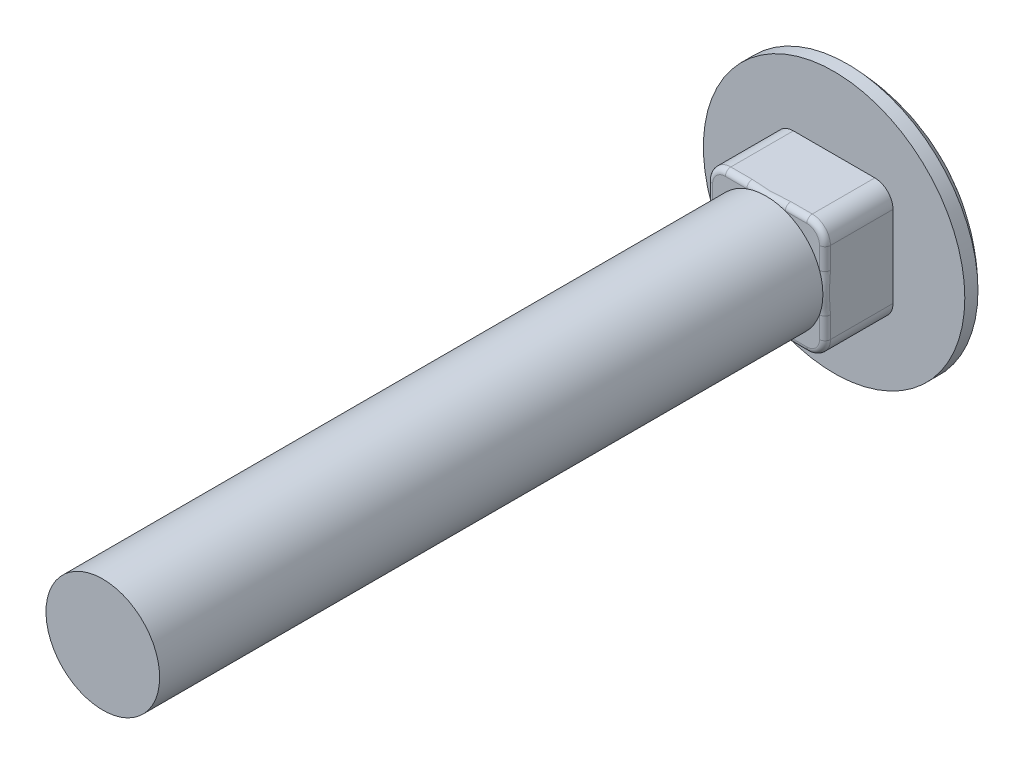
ISO-10303-21;
HEADER;
FILE_DESCRIPTION(('STEP AP214'),'2;1');
FILE_NAME('part.step','',(''),(''),'','','');
FILE_SCHEMA(('AUTOMOTIVE_DESIGN { 1 0 10303 214 1 1 1 1 }'));
ENDSEC;
DATA;
#1=APPLICATION_CONTEXT('core data for automotive mechanical design processes');
#2=APPLICATION_PROTOCOL_DEFINITION('international standard','automotive_design',2000,#1);
#3=PRODUCT_CONTEXT('',#1,'mechanical');
#4=PRODUCT('Part','Part','',(#3));
#5=PRODUCT_RELATED_PRODUCT_CATEGORY('part','',(#4));
#6=PRODUCT_DEFINITION_FORMATION('','',#4);
#7=PRODUCT_DEFINITION_CONTEXT('part definition',#1,'design');
#8=PRODUCT_DEFINITION('design','',#6,#7);
#9=PRODUCT_DEFINITION_SHAPE('','',#8);
#10=(LENGTH_UNIT() NAMED_UNIT(*) SI_UNIT(.MILLI.,.METRE.));
#11=(NAMED_UNIT(*) PLANE_ANGLE_UNIT() SI_UNIT($,.RADIAN.));
#12=(NAMED_UNIT(*) SI_UNIT($,.STERADIAN.) SOLID_ANGLE_UNIT());
#13=UNCERTAINTY_MEASURE_WITH_UNIT(LENGTH_MEASURE(1.E-05),#10,'distance_accuracy_value','');
#14=(GEOMETRIC_REPRESENTATION_CONTEXT(3) GLOBAL_UNCERTAINTY_ASSIGNED_CONTEXT((#13)) GLOBAL_UNIT_ASSIGNED_CONTEXT((#10,
#11,#12)) REPRESENTATION_CONTEXT('',''));
#15=CARTESIAN_POINT('',(0.,0.,0.));
#16=DIRECTION('',(0.,0.,1.));
#17=DIRECTION('',(1.,0.,0.));
#18=AXIS2_PLACEMENT_3D('',#15,#16,#17);
#19=CARTESIAN_POINT('',(-4.11480000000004,-4.1148,4.7498));
#20=DIRECTION('',(0.,0.,1.));
#21=DIRECTION('',(1.,0.,0.));
#22=AXIS2_PLACEMENT_3D('',#19,#20,#21);
#23=PLANE('',#22);
#24=CARTESIAN_POINT('',(2.84479999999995,-2.8448,4.7498));
#25=DIRECTION('',(0.,0.,1.));
#26=DIRECTION('',(1.,0.,0.));
#27=AXIS2_PLACEMENT_3D('',#24,#25,#26);
#28=CIRCLE('',#27,0.889);
#29=CARTESIAN_POINT('',(2.84479999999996,-3.7338,4.7498));
#30=VERTEX_POINT('',#29);
#31=CARTESIAN_POINT('',(3.73379999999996,-2.8448,4.7498));
#32=VERTEX_POINT('',#31);
#33=EDGE_CURVE('E505',#30,#32,#28,.T.);
#34=ORIENTED_EDGE('',*,*,#33,.T.);
#35=DIRECTION('',(0.,1.,0.));
#36=VECTOR('',#35,1.);
#37=CARTESIAN_POINT('',(3.73379999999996,2.8448,4.7498));
#38=LINE('',#37,#36);
#39=CARTESIAN_POINT('',(3.73379999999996,-1.34525615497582,4.7498));
#40=VERTEX_POINT('',#39);
#41=EDGE_CURVE('E506',#32,#40,#38,.T.);
#42=ORIENTED_EDGE('',*,*,#41,.T.);
#43=CARTESIAN_POINT('',(0.,0.,4.7498));
#44=DIRECTION('',(0.,0.,1.));
#45=DIRECTION('',(1.,0.,0.));
#46=AXIS2_PLACEMENT_3D('',#43,#44,#45);
#47=CIRCLE('',#46,3.96875);
#48=CARTESIAN_POINT('',(1.3452561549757,-3.7338,4.7498));
#49=VERTEX_POINT('',#48);
#50=EDGE_CURVE('E448',#49,#40,#47,.T.);
#51=ORIENTED_EDGE('',*,*,#50,.F.);
#52=DIRECTION('',(1.,0.,0.));
#53=VECTOR('',#52,1.);
#54=CARTESIAN_POINT('',(2.84479999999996,-3.7338,4.7498));
#55=LINE('',#54,#53);
#56=EDGE_CURVE('E503',#49,#30,#55,.T.);
#57=ORIENTED_EDGE('',*,*,#56,.T.);
#58=EDGE_LOOP('',(#34,#42,#51,#57));
#59=FACE_BOUND('',#58,.T.);
#60=ADVANCED_FACE('F38',(#59),#23,.T.);
#61=CARTESIAN_POINT('',(-2.84480000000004,-2.8448,4.7498));
#62=DIRECTION('',(0.,0.,1.));
#63=DIRECTION('',(1.,0.,0.));
#64=AXIS2_PLACEMENT_3D('',#61,#62,#63);
#65=CIRCLE('',#64,0.889);
#66=CARTESIAN_POINT('',(-3.73380000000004,-2.8448,4.7498));
#67=VERTEX_POINT('',#66);
#68=CARTESIAN_POINT('',(-2.84480000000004,-3.7338,4.7498));
#69=VERTEX_POINT('',#68);
#70=EDGE_CURVE('E499',#67,#69,#65,.T.);
#71=ORIENTED_EDGE('',*,*,#70,.T.);
#72=DIRECTION('',(1.,0.,0.));
#73=VECTOR('',#72,1.);
#74=CARTESIAN_POINT('',(2.84479999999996,-3.7338,4.7498));
#75=LINE('',#74,#73);
#76=CARTESIAN_POINT('',(-1.3452561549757,-3.7338,4.7498));
#77=VERTEX_POINT('',#76);
#78=EDGE_CURVE('E501',#69,#77,#75,.T.);
#79=ORIENTED_EDGE('',*,*,#78,.T.);
#80=CARTESIAN_POINT('',(-3.73380000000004,-1.34525615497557,4.7498));
#81=VERTEX_POINT('',#80);
#82=EDGE_CURVE('E586',#81,#77,#47,.T.);
#83=ORIENTED_EDGE('',*,*,#82,.F.);
#84=DIRECTION('',(0.,-1.,0.));
#85=VECTOR('',#84,1.);
#86=CARTESIAN_POINT('',(-3.73380000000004,-2.8448,4.7498));
#87=LINE('',#86,#85);
#88=EDGE_CURVE('E444',#81,#67,#87,.T.);
#89=ORIENTED_EDGE('',*,*,#88,.T.);
#90=EDGE_LOOP('',(#71,#79,#83,#89));
#91=FACE_BOUND('',#90,.T.);
#92=ADVANCED_FACE('F198',(#91),#23,.T.);
#93=CARTESIAN_POINT('',(-2.84480000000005,2.8448,4.7498));
#94=DIRECTION('',(0.,0.,1.));
#95=DIRECTION('',(1.,0.,0.));
#96=AXIS2_PLACEMENT_3D('',#93,#94,#95);
#97=CIRCLE('',#96,0.889);
#98=CARTESIAN_POINT('',(-2.84480000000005,3.7338,4.7498));
#99=VERTEX_POINT('',#98);
#100=CARTESIAN_POINT('',(-3.73380000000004,2.8448,4.7498));
#101=VERTEX_POINT('',#100);
#102=EDGE_CURVE('E495',#99,#101,#97,.T.);
#103=ORIENTED_EDGE('',*,*,#102,.T.);
#104=DIRECTION('',(0.,-1.,0.));
#105=VECTOR('',#104,1.);
#106=CARTESIAN_POINT('',(-3.73380000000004,-2.8448,4.7498));
#107=LINE('',#106,#105);
#108=CARTESIAN_POINT('',(-3.73380000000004,1.34525615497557,4.7498));
#109=VERTEX_POINT('',#108);
#110=EDGE_CURVE('E426',#101,#109,#107,.T.);
#111=ORIENTED_EDGE('',*,*,#110,.T.);
#112=CARTESIAN_POINT('',(-1.3452561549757,3.7338,4.7498));
#113=VERTEX_POINT('',#112);
#114=EDGE_CURVE('E583',#113,#109,#47,.T.);
#115=ORIENTED_EDGE('',*,*,#114,.F.);
#116=DIRECTION('',(-1.,0.,0.));
#117=VECTOR('',#116,1.);
#118=CARTESIAN_POINT('',(-2.84480000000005,3.7338,4.7498));
#119=LINE('',#118,#117);
#120=EDGE_CURVE('E244',#113,#99,#119,.T.);
#121=ORIENTED_EDGE('',*,*,#120,.T.);
#122=EDGE_LOOP('',(#103,#111,#115,#121));
#123=FACE_BOUND('',#122,.T.);
#124=ADVANCED_FACE('F205',(#123),#23,.T.);
#125=CARTESIAN_POINT('',(3.73379999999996,1.34525615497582,4.7498));
#126=VERTEX_POINT('',#125);
#127=CARTESIAN_POINT('',(1.3452561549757,3.7338,4.7498));
#128=VERTEX_POINT('',#127);
#129=EDGE_CURVE('E221',#126,#128,#47,.T.);
#130=ORIENTED_EDGE('',*,*,#129,.F.);
#131=DIRECTION('',(0.,1.,0.));
#132=VECTOR('',#131,1.);
#133=CARTESIAN_POINT('',(3.73379999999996,2.8448,4.7498));
#134=LINE('',#133,#132);
#135=CARTESIAN_POINT('',(3.73379999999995,2.8448,4.7498));
#136=VERTEX_POINT('',#135);
#137=EDGE_CURVE('E223',#126,#136,#134,.T.);
#138=ORIENTED_EDGE('',*,*,#137,.T.);
#139=CARTESIAN_POINT('',(2.84479999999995,2.8448,4.7498));
#140=DIRECTION('',(0.,0.,1.));
#141=DIRECTION('',(1.,0.,0.));
#142=AXIS2_PLACEMENT_3D('',#139,#140,#141);
#143=CIRCLE('',#142,0.889);
#144=CARTESIAN_POINT('',(2.84479999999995,3.7338,4.7498));
#145=VERTEX_POINT('',#144);
#146=EDGE_CURVE('E491',#136,#145,#143,.T.);
#147=ORIENTED_EDGE('',*,*,#146,.T.);
#148=DIRECTION('',(-1.,0.,0.));
#149=VECTOR('',#148,1.);
#150=CARTESIAN_POINT('',(-2.84480000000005,3.7338,4.7498));
#151=LINE('',#150,#149);
#152=EDGE_CURVE('E226',#145,#128,#151,.T.);
#153=ORIENTED_EDGE('',*,*,#152,.T.);
#154=EDGE_LOOP('',(#130,#138,#147,#153));
#155=FACE_BOUND('',#154,.T.);
#156=ADVANCED_FACE('F201',(#155),#23,.T.);
#157=CARTESIAN_POINT('',(0.,0.,0.));
#158=DIRECTION('',(0.,0.,-1.));
#159=DIRECTION('',(-1.,0.,0.));
#160=AXIS2_PLACEMENT_3D('',#157,#158,#159);
#161=PLANE('',#160);
#162=CARTESIAN_POINT('',(0.,0.,0.));
#163=DIRECTION('',(0.,0.,1.));
#164=DIRECTION('',(1.,0.,0.));
#165=AXIS2_PLACEMENT_3D('',#162,#163,#164);
#166=CIRCLE('',#165,9.1313);
#167=CARTESIAN_POINT('',(9.1313,0.,0.));
#168=VERTEX_POINT('',#167);
#169=EDGE_CURVE('E467',#168,#168,#166,.T.);
#170=ORIENTED_EDGE('',*,*,#169,.T.);
#171=EDGE_LOOP('',(#170));
#172=FACE_BOUND('',#171,.T.);
#173=DIRECTION('',(0.,-1.,0.));
#174=VECTOR('',#173,1.);
#175=CARTESIAN_POINT('',(-4.11480000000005,4.1148,0.));
#176=LINE('',#175,#174);
#177=CARTESIAN_POINT('',(-4.11480000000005,2.8448,0.));
#178=VERTEX_POINT('',#177);
#179=CARTESIAN_POINT('',(-4.11480000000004,-2.8448,0.));
#180=VERTEX_POINT('',#179);
#181=EDGE_CURVE('E453',#178,#180,#176,.T.);
#182=ORIENTED_EDGE('',*,*,#181,.F.);
#183=CARTESIAN_POINT('',(-2.84480000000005,2.8448,0.));
#184=DIRECTION('',(0.,0.,-1.));
#185=DIRECTION('',(-1.,0.,0.));
#186=AXIS2_PLACEMENT_3D('',#183,#184,#185);
#187=CIRCLE('',#186,1.27);
#188=CARTESIAN_POINT('',(-2.84480000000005,4.1148,0.));
#189=VERTEX_POINT('',#188);
#190=EDGE_CURVE('E413',#178,#189,#187,.T.);
#191=ORIENTED_EDGE('',*,*,#190,.T.);
#192=DIRECTION('',(-1.,0.,0.));
#193=VECTOR('',#192,1.);
#194=CARTESIAN_POINT('',(-4.11480000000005,4.1148,0.));
#195=LINE('',#194,#193);
#196=CARTESIAN_POINT('',(2.84479999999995,4.1148,0.));
#197=VERTEX_POINT('',#196);
#198=EDGE_CURVE('E461',#197,#189,#195,.T.);
#199=ORIENTED_EDGE('',*,*,#198,.F.);
#200=CARTESIAN_POINT('',(2.84479999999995,2.8448,0.));
#201=DIRECTION('',(0.,0.,-1.));
#202=DIRECTION('',(-1.,0.,0.));
#203=AXIS2_PLACEMENT_3D('',#200,#201,#202);
#204=CIRCLE('',#203,1.27);
#205=CARTESIAN_POINT('',(4.11479999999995,2.8448,0.));
#206=VERTEX_POINT('',#205);
#207=EDGE_CURVE('E489',#197,#206,#204,.T.);
#208=ORIENTED_EDGE('',*,*,#207,.T.);
#209=DIRECTION('',(0.,1.,0.));
#210=VECTOR('',#209,1.);
#211=CARTESIAN_POINT('',(4.11479999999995,4.1148,0.));
#212=LINE('',#211,#210);
#213=CARTESIAN_POINT('',(4.11479999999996,-2.8448,0.));
#214=VERTEX_POINT('',#213);
#215=EDGE_CURVE('E458',#214,#206,#212,.T.);
#216=ORIENTED_EDGE('',*,*,#215,.F.);
#217=CARTESIAN_POINT('',(2.84479999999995,-2.8448,0.));
#218=DIRECTION('',(0.,0.,-1.));
#219=DIRECTION('',(-1.,0.,0.));
#220=AXIS2_PLACEMENT_3D('',#217,#218,#219);
#221=CIRCLE('',#220,1.27);
#222=CARTESIAN_POINT('',(2.84479999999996,-4.1148,0.));
#223=VERTEX_POINT('',#222);
#224=EDGE_CURVE('E487',#214,#223,#221,.T.);
#225=ORIENTED_EDGE('',*,*,#224,.T.);
#226=DIRECTION('',(1.,0.,0.));
#227=VECTOR('',#226,1.);
#228=CARTESIAN_POINT('',(-4.11480000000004,-4.1148,0.));
#229=LINE('',#228,#227);
#230=CARTESIAN_POINT('',(-2.84480000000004,-4.1148,0.));
#231=VERTEX_POINT('',#230);
#232=EDGE_CURVE('E455',#231,#223,#229,.T.);
#233=ORIENTED_EDGE('',*,*,#232,.F.);
#234=CARTESIAN_POINT('',(-2.84480000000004,-2.8448,0.));
#235=DIRECTION('',(0.,0.,-1.));
#236=DIRECTION('',(-1.,0.,0.));
#237=AXIS2_PLACEMENT_3D('',#234,#235,#236);
#238=CIRCLE('',#237,1.27);
#239=EDGE_CURVE('E485',#231,#180,#238,.T.);
#240=ORIENTED_EDGE('',*,*,#239,.T.);
#241=EDGE_LOOP('',(#182,#191,#199,#208,#216,#225,#233,#240));
#242=FACE_BOUND('',#241,.T.);
#243=ADVANCED_FACE('F193',(#172,#242),#161,.F.);
#244=CARTESIAN_POINT('',(0.,0.,0.));
#245=DIRECTION('',(0.,0.,1.));
#246=DIRECTION('',(1.,0.,0.));
#247=AXIS2_PLACEMENT_3D('',#244,#245,#246);
#248=CYLINDRICAL_SURFACE('',#247,9.1313);
#249=ORIENTED_EDGE('',*,*,#169,.F.);
#250=EDGE_LOOP('',(#249));
#251=FACE_BOUND('',#250,.T.);
#252=CARTESIAN_POINT('',(0.,0.,-0.92075));
#253=DIRECTION('',(0.,0.,1.));
#254=DIRECTION('',(1.,0.,0.));
#255=AXIS2_PLACEMENT_3D('',#252,#253,#254);
#256=CIRCLE('',#255,9.1313);
#257=CARTESIAN_POINT('',(9.1313,0.,-0.92075));
#258=VERTEX_POINT('',#257);
#259=EDGE_CURVE('E464',#258,#258,#256,.T.);
#260=ORIENTED_EDGE('',*,*,#259,.T.);
#261=EDGE_LOOP('',(#260));
#262=FACE_BOUND('',#261,.T.);
#263=ADVANCED_FACE('F183',(#251,#262),#248,.T.);
#264=CARTESIAN_POINT('',(0.320228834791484,0.,8.22556209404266));
#265=DIRECTION('',(0.,-1.,0.));
#266=DIRECTION('',(1.,0.,0.));
#267=AXIS2_PLACEMENT_3D('',#264,#265,#266);
#268=CIRCLE('',#267,12.7);
#269=TRIMMED_CURVE('',#268,(PARAMETER_VALUE(-1.5960138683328)),
(PARAMETER_VALUE(1.5960138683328)),.T.,.PARAMETER.);
#270=CARTESIAN_POINT('',(0.,0.,8.22556209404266));
#271=DIRECTION('',(0.,0.,1.));
#272=AXIS1_PLACEMENT('',#270,#271);
#273=SURFACE_OF_REVOLUTION('',#269,#272);
#274=ORIENTED_EDGE('',*,*,#259,.F.);
#275=EDGE_LOOP('',(#274));
#276=FACE_BOUND('',#275,.T.);
#277=CARTESIAN_POINT('',(0.,0.,-4.4704));
#278=VERTEX_POINT('',#277);
#279=VERTEX_LOOP('',#278);
#280=FACE_BOUND('',#279,.T.);
#281=ADVANCED_FACE('F180',(#276,#280),#273,.T.);
#282=CARTESIAN_POINT('',(-4.11480000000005,4.1148,4.7498));
#283=DIRECTION('',(1.,0.,0.));
#284=DIRECTION('',(0.,1.,0.));
#285=AXIS2_PLACEMENT_3D('',#282,#283,#284);
#286=PLANE('',#285);
#287=DIRECTION('',(0.,0.,-1.));
#288=VECTOR('',#287,1.);
#289=CARTESIAN_POINT('',(-4.11480000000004,-2.8448,4.7498));
#290=LINE('',#289,#288);
#291=CARTESIAN_POINT('',(-4.11480000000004,-2.8448,4.3688));
#292=VERTEX_POINT('',#291);
#293=EDGE_CURVE('E417',#180,#292,#290,.F.);
#294=ORIENTED_EDGE('',*,*,#293,.T.);
#295=DIRECTION('',(0.,-1.,0.));
#296=VECTOR('',#295,1.);
#297=CARTESIAN_POINT('',(-4.11480000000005,2.8448,4.3688));
#298=LINE('',#297,#296);
#299=CARTESIAN_POINT('',(-4.11480000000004,-1.34525615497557,4.3688));
#300=VERTEX_POINT('',#299);
#301=EDGE_CURVE('E349',#292,#300,#298,.F.);
#302=ORIENTED_EDGE('',*,*,#301,.T.);
#303=CARTESIAN_POINT('',(-4.11480000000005,1.92293445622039,4.44690922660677));
#304=CARTESIAN_POINT('',(-4.11480000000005,1.84844319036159,4.66012462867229));
#305=CARTESIAN_POINT('',(-3.91665918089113,1.81269145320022,4.76245637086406));
#306=CARTESIAN_POINT('',(-3.71851836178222,1.77693971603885,4.86478811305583));
#307=CARTESIAN_POINT('',(-3.52832482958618,1.81711322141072,4.7498));
#308=CARTESIAN_POINT('',(-4.11480000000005,1.88940177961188,4.43525110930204));
#309=CARTESIAN_POINT('',(-4.11480000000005,1.82458174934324,4.64631769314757));
#310=CARTESIAN_POINT('',(-3.92337164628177,1.79196673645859,4.75128456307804));
#311=CARTESIAN_POINT('',(-3.73186903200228,1.75962883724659,4.85638033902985));
#312=CARTESIAN_POINT('',(-3.54122389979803,1.79207592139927,4.7498));
#313=CARTESIAN_POINT('',(-4.11480000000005,1.85532432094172,4.42536743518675));
#314=CARTESIAN_POINT('',(-4.11480000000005,1.7985193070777,4.63360252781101));
#315=CARTESIAN_POINT('',(-3.92977073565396,1.76897536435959,4.7406766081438));
#316=CARTESIAN_POINT('',(-3.74467840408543,1.73969987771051,4.84785481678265));
#317=CARTESIAN_POINT('',(-3.55420578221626,1.76620545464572,4.7498));
#318=CARTESIAN_POINT('',(-4.11480000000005,1.78650622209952,4.40854081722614));
#319=CARTESIAN_POINT('',(-4.11480000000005,1.74347635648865,4.61049035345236));
#320=CARTESIAN_POINT('',(-3.94198262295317,1.71962829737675,4.72078684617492));
#321=CARTESIAN_POINT('',(-3.76910043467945,1.69602869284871,4.83118750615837));
#322=CARTESIAN_POINT('',(-3.58010796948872,1.71308665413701,4.7498));
#323=CARTESIAN_POINT('',(-4.11480000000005,1.75176689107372,4.40159259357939));
#324=CARTESIAN_POINT('',(-4.11480000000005,1.71450108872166,4.60005254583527));
#325=CARTESIAN_POINT('',(-3.94779645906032,1.69327875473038,4.71150267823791));
#326=CARTESIAN_POINT('',(-3.78074100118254,1.67230880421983,4.82303192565));
#327=CARTESIAN_POINT('',(-3.5930283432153,1.68584089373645,4.7498));
#328=CARTESIAN_POINT('',(-4.11480000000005,1.6822396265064,4.3900429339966));
#329=CARTESIAN_POINT('',(-4.11480000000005,1.6549513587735,4.58144696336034));
#330=CARTESIAN_POINT('',(-3.95885256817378,1.63854692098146,4.69449359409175));
#331=CARTESIAN_POINT('',(-3.80285526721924,1.62239389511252,4.8076176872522));
#332=CARTESIAN_POINT('',(-3.61851402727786,1.63041647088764,4.7498));
#333=CARTESIAN_POINT('',(-4.11480000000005,1.64745489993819,4.38542108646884));
#334=CARTESIAN_POINT('',(-4.11480000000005,1.6243837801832,4.57323187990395));
#335=CARTESIAN_POINT('',(-3.96409948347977,1.61018489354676,4.68675548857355));
#336=CARTESIAN_POINT('',(-3.81335785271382,1.59622490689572,4.80033740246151));
#337=CARTESIAN_POINT('',(-3.63108147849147,1.60224831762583,4.7498));
#338=CARTESIAN_POINT('',(-4.11480000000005,1.57769475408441,4.37802776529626));
#339=CARTESIAN_POINT('',(-4.11480000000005,1.56197178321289,4.55869082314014));
#340=CARTESIAN_POINT('',(-3.97412867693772,1.55179985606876,4.67264917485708));
#341=CARTESIAN_POINT('',(-3.83341686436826,1.54186408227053,4.78666400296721));
#342=CARTESIAN_POINT('',(-3.65585937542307,1.54487723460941,4.7498));
#343=CARTESIAN_POINT('',(-4.11480000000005,1.54271933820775,4.37525625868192));
#344=CARTESIAN_POINT('',(-4.11480000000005,1.53011129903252,4.55234341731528));
#345=CARTESIAN_POINT('',(-3.97891096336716,1.52177687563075,4.66628094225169));
#346=CARTESIAN_POINT('',(-3.84298942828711,1.51366562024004,4.78025792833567));
#347=CARTESIAN_POINT('',(-3.6680698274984,1.51567432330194,4.7498));
#348=CARTESIAN_POINT('',(-4.11480000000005,1.42446188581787,4.36843048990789));
#349=CARTESIAN_POINT('',(-4.11480000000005,1.42158530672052,4.53377995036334));
#350=CARTESIAN_POINT('',(-3.99435088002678,1.41832323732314,4.64689981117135));
#351=CARTESIAN_POINT('',(-3.87371427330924,1.41630468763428,4.76025814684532));
#352=CARTESIAN_POINT('',(-3.70853568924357,1.41545656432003,4.7498));
#353=CARTESIAN_POINT('',(-4.11480000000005,1.34098502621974,4.36786573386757));
#354=CARTESIAN_POINT('',(-4.11480000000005,1.34218416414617,4.5251527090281));
#355=CARTESIAN_POINT('',(-4.00403019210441,1.34205214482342,4.63681344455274));
#356=CARTESIAN_POINT('',(-3.8931439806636,1.34295149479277,4.74857654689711));
#357=CARTESIAN_POINT('',(-3.73573040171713,1.34224358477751,4.7498));
#358=CARTESIAN_POINT('',(-4.11480000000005,1.17414361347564,4.37192356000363));
#359=CARTESIAN_POINT('',(-4.11480000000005,1.18126790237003,4.51433166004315));
#360=CARTESIAN_POINT('',(-4.02138988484,1.18566018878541,4.62193866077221));
#361=CARTESIAN_POINT('',(-3.92786782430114,1.1910780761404,4.72963898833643));
#362=CARTESIAN_POINT('',(-3.78657101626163,1.19130879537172,4.7498));
#363=CARTESIAN_POINT('',(-4.11480000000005,1.09077932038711,4.37655245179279));
#364=CARTESIAN_POINT('',(-4.11480000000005,1.09951281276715,4.51204408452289));
#365=CARTESIAN_POINT('',(-4.02906782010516,1.10553475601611,4.61715670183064));
#366=CARTESIAN_POINT('',(-3.94326795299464,1.11236881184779,4.72229960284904));
#367=CARTESIAN_POINT('',(-3.8102125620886,1.1135816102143,4.7498));
#368=CARTESIAN_POINT('',(-4.11480000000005,0.923970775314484,4.38855341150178));
#369=CARTESIAN_POINT('',(-4.11480000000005,0.934647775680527,4.51144737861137));
#370=CARTESIAN_POINT('',(-4.04264532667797,0.942545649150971,4.61117739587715));
#371=CARTESIAN_POINT('',(-3.97042339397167,0.951251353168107,4.7109365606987));
#372=CARTESIAN_POINT('',(-3.85326852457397,0.954016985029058,4.7498));
#373=CARTESIAN_POINT('',(-4.11480000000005,0.840527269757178,4.39593505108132));
#374=CARTESIAN_POINT('',(-4.11480000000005,0.851312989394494,4.51311194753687));
#375=CARTESIAN_POINT('',(-4.04853856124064,0.859673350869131,4.60999268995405));
#376=CARTESIAN_POINT('',(-3.98224048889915,0.868638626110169,4.706875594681));
#377=CARTESIAN_POINT('',(-3.87266781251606,0.872166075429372,4.7498));
#378=CARTESIAN_POINT('',(-4.11480000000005,0.673718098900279,4.41115470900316));
#379=CARTESIAN_POINT('',(-4.11480000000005,0.683997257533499,4.51825228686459));
#380=CARTESIAN_POINT('',(-4.05861892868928,0.692210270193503,4.60964231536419));
#381=CARTESIAN_POINT('',(-4.0024019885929,0.701022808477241,4.70103270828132));
#382=CARTESIAN_POINT('',(-3.90651166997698,0.705259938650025,4.7498));
#383=CARTESIAN_POINT('',(-4.11480000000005,0.590352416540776,4.41899256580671));
#384=CARTESIAN_POINT('',(-4.11480000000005,0.599813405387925,4.52172086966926));
#385=CARTESIAN_POINT('',(-4.06280666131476,0.607620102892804,4.61047593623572));
#386=CARTESIAN_POINT('',(-4.0107974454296,0.615829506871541,4.69922645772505));
#387=CARTESIAN_POINT('',(-3.92095798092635,0.620205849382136,4.7498));
#388=CARTESIAN_POINT('',(-4.11480000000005,0.422811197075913,4.43295373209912));
#389=CARTESIAN_POINT('',(-4.11480000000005,0.430273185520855,4.52845913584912));
#390=CARTESIAN_POINT('',(-4.06954770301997,0.436479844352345,4.61266921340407));
#391=CARTESIAN_POINT('',(-4.02427943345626,0.44309239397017,4.69687347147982));
#392=CARTESIAN_POINT('',(-3.94448024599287,0.446934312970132,4.7498));
#393=CARTESIAN_POINT('',(-4.11480000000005,0.338634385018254,4.4390633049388));
#394=CARTESIAN_POINT('',(-4.11480000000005,0.344709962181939,4.53173630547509));
#395=CARTESIAN_POINT('',(-4.07208811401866,0.349919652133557,4.6140328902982));
#396=CARTESIAN_POINT('',(-4.02937222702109,0.355334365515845,4.69632768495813));
#397=CARTESIAN_POINT('',(-3.95351377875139,0.35869748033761,4.7498));
#398=CARTESIAN_POINT('',(-4.11480000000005,0.170097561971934,4.44750725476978));
#399=CARTESIAN_POINT('',(-4.11480000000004,0.173332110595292,4.53634460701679));
#400=CARTESIAN_POINT('',(-4.07548286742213,0.176048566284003,4.61602911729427));
#401=CARTESIAN_POINT('',(-4.03616174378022,0.178969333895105,4.69571071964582));
#402=CARTESIAN_POINT('',(-3.96563093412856,0.180796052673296,4.7498));
#403=CARTESIAN_POINT('',(-4.11480000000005,0.0857376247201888,4.44984294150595));
#404=CARTESIAN_POINT('',(-4.11480000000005,0.0873179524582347,4.53768636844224));
#405=CARTESIAN_POINT('',(-4.07633779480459,0.0887379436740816,4.61666192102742));
#406=CARTESIAN_POINT('',(-4.03787555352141,0.0901585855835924,4.69563754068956));
#407=CARTESIAN_POINT('',(-3.96871662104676,0.0911319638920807,4.7498));
#408=CARTESIAN_POINT('',(-4.11480000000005,-0.0828427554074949,4.44989164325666));
#409=CARTESIAN_POINT('',(-4.11480000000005,-0.0843686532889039,4.53771390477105));
#410=CARTESIAN_POINT('',(-4.07635612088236,-0.085741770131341,4.61667469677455));
#411=CARTESIAN_POINT('',(-4.03791227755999,-0.0871133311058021,4.69563542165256));
#412=CARTESIAN_POINT('',(-3.96878278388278,-0.0880549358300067,4.7498));
#413=CARTESIAN_POINT('',(-4.11480000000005,-0.1670631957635,4.4476123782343));
#414=CARTESIAN_POINT('',(-4.11480000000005,-0.170241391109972,4.5364041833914));
#415=CARTESIAN_POINT('',(-4.07552234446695,-0.172910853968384,4.61605676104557));
#416=CARTESIAN_POINT('',(-4.03624094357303,-0.175781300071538,4.69570623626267));
#417=CARTESIAN_POINT('',(-3.9657734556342,-0.177577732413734,4.7498));
#418=CARTESIAN_POINT('',(-4.11480000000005,-0.335323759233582,4.43927482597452));
#419=CARTESIAN_POINT('',(-4.11480000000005,-0.341345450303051,4.53184989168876));
#420=CARTESIAN_POINT('',(-4.07217566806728,-0.346511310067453,4.61408034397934));
#421=CARTESIAN_POINT('',(-4.02954731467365,-0.351879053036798,4.69630931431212));
#422=CARTESIAN_POINT('',(-3.95382472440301,-0.35521765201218,4.7498));
#423=CARTESIAN_POINT('',(-4.11480000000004,-0.419363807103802,4.43321518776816));
#424=CARTESIAN_POINT('',(-4.11480000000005,-0.426775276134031,4.5285947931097));
#425=CARTESIAN_POINT('',(-4.06966216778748,-0.432942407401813,4.61272159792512));
#426=CARTESIAN_POINT('',(-4.0245081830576,-0.439511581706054,4.6968435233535));
#427=CARTESIAN_POINT('',(-3.94488320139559,-0.443334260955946,4.7498));
#428=CARTESIAN_POINT('',(-4.11480000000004,-0.550039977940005,4.42236552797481));
#429=CARTESIAN_POINT('',(-4.11480000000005,-0.558886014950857,4.52334946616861));
#430=CARTESIAN_POINT('',(-4.06444134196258,-0.566450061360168,4.61100000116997));
#431=CARTESIAN_POINT('',(-4.01407802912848,-0.574139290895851,4.69864875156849));
#432=CARTESIAN_POINT('',(-3.92666024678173,-0.578532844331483,4.7498));
#433=CARTESIAN_POINT('',(-4.11480000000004,-0.59673409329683,4.41820438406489));
#434=CARTESIAN_POINT('',(-4.11480000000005,-0.606072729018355,4.52143330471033));
#435=CARTESIAN_POINT('',(-4.06231440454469,-0.613979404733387,4.61046272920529));
#436=CARTESIAN_POINT('',(-4.0098208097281,-0.622045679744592,4.69949096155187));
#437=CARTESIAN_POINT('',(-3.91928843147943,-0.626481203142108,4.7498));
#438=CARTESIAN_POINT('',(-4.11480000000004,-0.690114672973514,4.40970830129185));
#439=CARTESIAN_POINT('',(-4.11480000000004,-0.700167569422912,4.5178752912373));
#440=CARTESIAN_POINT('',(-4.05753341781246,-0.708564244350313,4.60980522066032));
#441=CARTESIAN_POINT('',(-4.00025867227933,-0.717121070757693,4.70173411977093));
#442=CARTESIAN_POINT('',(-3.90291844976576,-0.721474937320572,4.7498));
#443=CARTESIAN_POINT('',(-4.11480000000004,-0.736801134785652,4.40537333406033));
#444=CARTESIAN_POINT('',(-4.11480000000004,-0.747110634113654,4.51623305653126));
#445=CARTESIAN_POINT('',(-4.05487928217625,-0.755619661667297,4.60968505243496));
#446=CARTESIAN_POINT('',(-3.99494637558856,-0.764323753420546,4.70313791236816));
#447=CARTESIAN_POINT('',(-3.89392001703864,-0.768520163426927,4.7498));
#448=CARTESIAN_POINT('',(-4.11480000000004,-0.830271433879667,4.39691504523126));
#449=CARTESIAN_POINT('',(-4.11480000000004,-0.840747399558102,4.51357881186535));
#450=CARTESIAN_POINT('',(-4.04902850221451,-0.849235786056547,4.61013040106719));
#451=CARTESIAN_POINT('',(-3.98324471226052,-0.85792081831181,4.70668299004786));
#452=CARTESIAN_POINT('',(-3.8743770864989,-0.861653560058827,4.7498));
#453=CARTESIAN_POINT('',(-4.11480000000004,-0.87705530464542,4.39279208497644));
#454=CARTESIAN_POINT('',(-4.11480000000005,-0.887476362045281,4.51256946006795));
#455=CARTESIAN_POINT('',(-4.04583096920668,-0.895795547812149,4.61069705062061));
#456=CARTESIAN_POINT('',(-3.97684443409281,-0.904347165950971,4.70882999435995));
#457=CARTESIAN_POINT('',(-3.86383005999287,-0.907740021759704,4.7498));
#458=CARTESIAN_POINT('',(-4.11480000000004,-0.970672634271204,4.38516730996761));
#459=CARTESIAN_POINT('',(-4.11480000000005,-0.980535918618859,4.51156015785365));
#460=CARTESIAN_POINT('',(-4.03887845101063,-0.988219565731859,4.61279932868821));
#461=CARTESIAN_POINT('',(-3.96293935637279,-0.996136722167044,4.7140437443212));
#462=CARTESIAN_POINT('',(-3.84130809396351,-0.998762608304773,4.7498));
#463=CARTESIAN_POINT('',(-4.11480000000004,-1.01750609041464,4.381665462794));
#464=CARTESIAN_POINT('',(-4.11480000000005,-1.02690412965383,4.5115648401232));
#465=CARTESIAN_POINT('',(-4.03512349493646,-1.03408385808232,4.61433490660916));
#466=CARTESIAN_POINT('',(-3.95542309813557,-1.0415336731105,4.71711732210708));
#467=CARTESIAN_POINT('',(-3.82933322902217,-1.04369879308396,4.7498));
#468=CARTESIAN_POINT('',(-4.11480000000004,-1.12744404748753,4.37466368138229));
#469=CARTESIAN_POINT('',(-4.11480000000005,-1.13518605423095,4.51322102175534));
#470=CARTESIAN_POINT('',(-4.0256309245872,-1.14065900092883,4.61941412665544));
#471=CARTESIAN_POINT('',(-3.93641770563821,-1.14662505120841,4.72563144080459));
#472=CARTESIAN_POINT('',(-3.79970544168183,-1.14763146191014,4.7498));
#473=CARTESIAN_POINT('',(-4.11480000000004,-1.19057711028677,4.37158281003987));
#474=CARTESIAN_POINT('',(-4.11480000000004,-1.19686658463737,4.51545842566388));
#475=CARTESIAN_POINT('',(-4.01965662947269,-1.20102182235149,4.62346840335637));
#476=CARTESIAN_POINT('',(-3.92444892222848,-1.20576268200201,4.73153250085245));
#477=CARTESIAN_POINT('',(-3.78152060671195,-1.20611902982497,4.7498));
#478=CARTESIAN_POINT('',(-4.11480000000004,-1.31685076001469,4.36839693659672));
#479=CARTESIAN_POINT('',(-4.11480000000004,-1.31870320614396,4.52349988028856));
#480=CARTESIAN_POINT('',(-4.00656336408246,-1.31947005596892,4.63460113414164));
#481=CARTESIAN_POINT('',(-3.89826124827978,-1.32082563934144,4.74575865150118));
#482=CARTESIAN_POINT('',(-3.74312479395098,-1.32046321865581,4.7498));
#483=CARTESIAN_POINT('',(-4.11480000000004,-1.37999119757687,4.36828753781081));
#484=CARTESIAN_POINT('',(-4.11480000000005,-1.37896416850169,4.52934205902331));
#485=CARTESIAN_POINT('',(-3.99944610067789,-1.37755870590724,4.64167510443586));
#486=CARTESIAN_POINT('',(-3.88399788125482,-1.37683492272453,4.75411812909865));
#487=CARTESIAN_POINT('',(-3.72291685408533,-1.37632360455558,4.7498));
#488=CARTESIAN_POINT('',(-4.11480000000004,-1.47941785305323,4.37152149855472));
#489=CARTESIAN_POINT('',(-4.11480000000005,-1.47177021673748,4.54225813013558));
#490=CARTESIAN_POINT('',(-3.98720207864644,-1.46645809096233,4.65582921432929));
#491=CARTESIAN_POINT('',(-3.85957294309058,-1.46137442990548,4.76943583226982));
#492=CARTESIAN_POINT('',(-3.68976966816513,-1.46209027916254,4.7498));
#493=CARTESIAN_POINT('',(-4.11480000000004,-1.51574851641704,4.37342173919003));
#494=CARTESIAN_POINT('',(-4.11480000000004,-1.50540660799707,4.54780063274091));
#495=CARTESIAN_POINT('',(-3.98250943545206,-1.49839945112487,4.66163712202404));
#496=CARTESIAN_POINT('',(-3.85018014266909,-1.49163699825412,4.77552456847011));
#497=CARTESIAN_POINT('',(-3.67737792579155,-1.49296628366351,4.7498));
#498=CARTESIAN_POINT('',(-4.11480000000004,-1.58825773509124,4.3789918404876));
#499=CARTESIAN_POINT('',(-4.11480000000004,-1.57151230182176,4.56072098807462));
#500=CARTESIAN_POINT('',(-3.97265387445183,-1.56076020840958,4.67465555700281));
#501=CARTESIAN_POINT('',(-3.83046874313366,-1.55025527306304,4.78864185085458));
#502=CARTESIAN_POINT('',(-3.65215378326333,-1.5536500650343,4.7498));
#503=CARTESIAN_POINT('',(-4.11480000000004,-1.62443636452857,4.38266070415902));
#504=CARTESIAN_POINT('',(-4.11480000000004,-1.60400157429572,4.56811797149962));
#505=CARTESIAN_POINT('',(-3.96749122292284,-1.59118045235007,4.68186529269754));
#506=CARTESIAN_POINT('',(-3.82013478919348,-1.5786222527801,4.79568300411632));
#507=CARTESIAN_POINT('',(-3.63932163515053,-1.58345843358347,4.7498));
#508=CARTESIAN_POINT('',(-4.11480000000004,-1.69671491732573,4.39218734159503));
#509=CARTESIAN_POINT('',(-4.11480000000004,-1.66752276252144,4.58506805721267));
#510=CARTESIAN_POINT('',(-3.95661637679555,-1.65015954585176,4.69785878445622));
#511=CARTESIAN_POINT('',(-3.79838334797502,-1.6330597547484,4.81072186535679));
#512=CARTESIAN_POINT('',(-3.61325785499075,-1.64206431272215,4.7498));
#513=CARTESIAN_POINT('',(-4.11480000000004,-1.73281342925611,4.398056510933));
#514=CARTESIAN_POINT('',(-4.11480000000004,-1.69856134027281,4.59465950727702));
#515=CARTESIAN_POINT('',(-3.9509014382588,-1.6787077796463,4.70665060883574));
#516=CARTESIAN_POINT('',(-3.7869408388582,-1.65912093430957,4.81873985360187));
#517=CARTESIAN_POINT('',(-3.60002447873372,-1.6708556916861,4.7498));
#518=CARTESIAN_POINT('',(-4.11480000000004,-1.80451514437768,4.4125797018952));
#519=CARTESIAN_POINT('',(-4.11480000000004,-1.75814099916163,4.61618380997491));
#520=CARTESIAN_POINT('',(-3.93887481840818,-1.73285444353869,4.7257524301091));
#521=CARTESIAN_POINT('',(-3.76288953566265,-1.70785122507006,4.83541690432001));
#522=CARTESIAN_POINT('',(-3.57337813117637,-1.72711447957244,4.7498));
#523=CARTESIAN_POINT('',(-4.11480000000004,-1.84011716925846,4.42123945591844));
#524=CARTESIAN_POINT('',(-4.11480000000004,-1.78668431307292,4.62815761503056));
#525=CARTESIAN_POINT('',(-3.93256192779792,-1.75844665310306,4.73606552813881));
#526=CARTESIAN_POINT('',(-3.75025292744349,-1.73050546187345,4.84409317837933));
#527=CARTESIAN_POINT('',(-3.55996484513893,-1.75457902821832,4.7498));
#528=CARTESIAN_POINT('',(-4.11480000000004,-1.87528315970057,4.43158323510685));
#529=CARTESIAN_POINT('',(-4.11480000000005,-1.81329911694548,4.64133467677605));
#530=CARTESIAN_POINT('',(-3.92592659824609,-1.78204246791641,4.74710588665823));
#531=CARTESIAN_POINT('',(-3.73705319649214,-1.75078581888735,4.8528770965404));
#532=CARTESIAN_POINT('',(-3.54656708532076,-1.78124632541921,4.7498));
#533=(BOUNDED_SURFACE() B_SPLINE_SURFACE(3,2,((#303,#304,#305,#306,#307),(#308,#309,#310,#311,
#312),(#313,#314,#315,#316,#317),(#318,#319,#320,#321,#322),(#323,#324,#325,#326,#327),(#328,
#329,#330,#331,#332),(#333,#334,#335,#336,#337),(#338,#339,#340,#341,#342),(#343,#344,#345,#346,
#347),(#348,#349,#350,#351,#352),(#353,#354,#355,#356,#357),(#358,#359,#360,#361,#362),(#363,
#364,#365,#366,#367),(#368,#369,#370,#371,#372),(#373,#374,#375,#376,#377),(#378,#379,#380,#381,
#382),(#383,#384,#385,#386,#387),(#388,#389,#390,#391,#392),(#393,#394,#395,#396,#397),(#398,
#399,#400,#401,#402),(#403,#404,#405,#406,#407),(#408,#409,#410,#411,#412),(#413,#414,#415,#416,
#417),(#418,#419,#420,#421,#422),(#423,#424,#425,#426,#427),(#428,#429,#430,#431,#432),(#433,
#434,#435,#436,#437),(#438,#439,#440,#441,#442),(#443,#444,#445,#446,#447),(#448,#449,#450,#451,
#452),(#453,#454,#455,#456,#457),(#458,#459,#460,#461,#462),(#463,#464,#465,#466,#467),(#468,
#469,#470,#471,#472),(#473,#474,#475,#476,#477),(#478,#479,#480,#481,#482),(#483,#484,#485,#486,
#487),(#488,#489,#490,#491,#492),(#493,#494,#495,#496,#497),(#498,#499,#500,#501,#502),(#503,
#504,#505,#506,#507),(#508,#509,#510,#511,#512),(#513,#514,#515,#516,#517),(#518,#519,#520,#521,
#522),(#523,#524,#525,#526,#527),(#528,#529,#530,#531,#532)),.UNSPECIFIED.,.F.,.F.,
.F.) B_SPLINE_SURFACE_WITH_KNOTS((4,2,2,2,2,2,2,2,2,2,2,2,2,2,2,2,2,2,2,2,2,2,4),(3,2,3),(0.,
0.106358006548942,0.212523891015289,0.317741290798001,0.42295681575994,0.67306615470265,
0.923479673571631,1.17477215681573,1.42597619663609,1.67912407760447,1.93218408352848,
2.18482111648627,2.43754848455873,2.57818703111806,2.71884862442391,2.85974251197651,
3.00062904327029,3.19021429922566,3.37951902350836,3.48862521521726,3.59766997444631,
3.70728746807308,3.81713158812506),(0.,0.5,1.),
.UNSPECIFIED.) GEOMETRIC_REPRESENTATION_ITEM() RATIONAL_B_SPLINE_SURFACE(((1.,0.860216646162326,
1.,0.860216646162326,1.),(1.,0.865335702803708,1.,0.865335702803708,1.),(1.,0.870172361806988,
1.,0.870172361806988,1.),(1.,0.879333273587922,1.,0.879333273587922,1.),(1.,0.883658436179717,
1.,0.883658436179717,1.),(1.,0.891830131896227,1.,0.891830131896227,1.),(1.,0.895680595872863,
1.,0.895680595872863,1.),(1.,0.902997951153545,1.,0.902997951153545,1.),(1.,0.906464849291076,
1.,0.906464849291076,1.),(1.,0.917601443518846,1.,0.917601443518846,1.),(1.,0.924484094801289,
1.,0.924484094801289,1.),(1.,0.936723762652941,1.,0.936723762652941,1.),(1.,0.942078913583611,
1.,0.942078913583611,1.),(1.,0.951488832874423,1.,0.951488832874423,1.),(1.,0.955538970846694,
1.,0.955538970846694,1.),(1.,0.96243615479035,1.,0.96243615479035,1.),(1.,0.965283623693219,1.,
0.965283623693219,1.),(1.,0.969855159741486,1.,0.969855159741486,1.),(1.,0.971570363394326,1.,
0.971570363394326,1.),(1.,0.973860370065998,1.,0.973860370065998,1.),(1.,0.974435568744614,1.,
0.974435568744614,1.),(1.,0.974447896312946,1.,0.974447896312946,1.),(1.,0.973886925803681,1.,
0.973886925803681,1.),(1.,0.971629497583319,1.,0.971629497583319,1.),(1.,0.969932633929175,1.,
0.969932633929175,1.),(1.,0.966392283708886,1.,0.966392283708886,1.),(1.,0.964947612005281,1.,
0.964947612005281,1.),(1.,0.961691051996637,1.,0.961691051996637,1.),(1.,0.959879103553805,1.,
0.959879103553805,1.),(1.,0.955871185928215,1.,0.955871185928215,1.),(1.,0.953674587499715,1.,
0.953674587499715,1.),(1.,0.94887889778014,1.,0.94887889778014,1.),(1.,0.946279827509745,1.,
0.946279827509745,1.),(1.,0.9396779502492,1.,0.9396779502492,1.),(1.,0.935500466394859,1.,
0.935500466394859,1.),(1.,0.926271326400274,1.,0.926271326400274,1.),(1.,0.921220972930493,1.,
0.921220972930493,1.),(1.,0.912446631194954,1.,0.912446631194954,1.),(1.,0.909067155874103,1.,
0.909067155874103,1.),(1.,0.90192531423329,1.,0.90192531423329,1.),(1.,0.898163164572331,1.,
0.898163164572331,1.),(1.,0.890183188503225,1.,0.890183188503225,1.),(1.,0.885963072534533,1.,
0.885963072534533,1.),(1.,0.877010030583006,1.,0.877010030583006,1.),(1.,0.872276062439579,1.,
0.872276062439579,1.),(1.,0.867256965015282,1.,0.867256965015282,1.))) REPRESENTATION_ITEM('') SURFACE());
#534=CARTESIAN_POINT('',(-4.11480000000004,-1.87528315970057,4.43158323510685));
#535=CARTESIAN_POINT('',(-4.11480000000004,-1.84011716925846,4.42123945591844));
#536=CARTESIAN_POINT('',(-4.11480000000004,-1.80451514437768,4.4125797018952));
#537=CARTESIAN_POINT('',(-4.11480000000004,-1.73281342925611,4.398056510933));
#538=CARTESIAN_POINT('',(-4.11480000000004,-1.69671491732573,4.39218734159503));
#539=CARTESIAN_POINT('',(-4.11480000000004,-1.62443636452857,4.38266070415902));
#540=CARTESIAN_POINT('',(-4.11480000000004,-1.58825773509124,4.3789918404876));
#541=CARTESIAN_POINT('',(-4.11480000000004,-1.51574851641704,4.37342173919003));
#542=CARTESIAN_POINT('',(-4.11480000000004,-1.47941785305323,4.37152149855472));
#543=CARTESIAN_POINT('',(-4.11480000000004,-1.37999119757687,4.36828753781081));
#544=CARTESIAN_POINT('',(-4.11480000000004,-1.31685076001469,4.36839693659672));
#545=CARTESIAN_POINT('',(-4.11480000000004,-1.19057711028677,4.37158281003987));
#546=CARTESIAN_POINT('',(-4.11480000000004,-1.12744404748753,4.37466368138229));
#547=CARTESIAN_POINT('',(-4.11480000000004,-1.01750609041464,4.381665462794));
#548=CARTESIAN_POINT('',(-4.11480000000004,-0.970672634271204,4.38516730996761));
#549=CARTESIAN_POINT('',(-4.11480000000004,-0.87705530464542,4.39279208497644));
#550=CARTESIAN_POINT('',(-4.11480000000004,-0.830271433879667,4.39691504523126));
#551=CARTESIAN_POINT('',(-4.11480000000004,-0.736801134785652,4.40537333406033));
#552=CARTESIAN_POINT('',(-4.11480000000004,-0.690114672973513,4.40970830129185));
#553=CARTESIAN_POINT('',(-4.11480000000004,-0.59673409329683,4.41820438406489));
#554=CARTESIAN_POINT('',(-4.11480000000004,-0.550039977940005,4.42236552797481));
#555=CARTESIAN_POINT('',(-4.11480000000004,-0.419363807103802,4.43321518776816));
#556=CARTESIAN_POINT('',(-4.11480000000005,-0.335323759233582,4.43927482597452));
#557=CARTESIAN_POINT('',(-4.11480000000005,-0.1670631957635,4.4476123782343));
#558=CARTESIAN_POINT('',(-4.11480000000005,-0.082842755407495,4.44989164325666));
#559=CARTESIAN_POINT('',(-4.11480000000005,0.0857376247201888,4.44984294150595));
#560=CARTESIAN_POINT('',(-4.11480000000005,0.170097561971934,4.44750725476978));
#561=CARTESIAN_POINT('',(-4.11480000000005,0.338634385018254,4.4390633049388));
#562=CARTESIAN_POINT('',(-4.11480000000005,0.422811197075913,4.43295373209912));
#563=CARTESIAN_POINT('',(-4.11480000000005,0.590352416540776,4.41899256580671));
#564=CARTESIAN_POINT('',(-4.11480000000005,0.673718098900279,4.41115470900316));
#565=CARTESIAN_POINT('',(-4.11480000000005,0.840527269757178,4.39593505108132));
#566=CARTESIAN_POINT('',(-4.11480000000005,0.923970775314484,4.38855341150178));
#567=CARTESIAN_POINT('',(-4.11480000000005,1.09077932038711,4.37655245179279));
#568=CARTESIAN_POINT('',(-4.11480000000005,1.17414361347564,4.37192356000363));
#569=CARTESIAN_POINT('',(-4.11480000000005,1.34098502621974,4.36786573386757));
#570=CARTESIAN_POINT('',(-4.11480000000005,1.42446188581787,4.36843048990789));
#571=CARTESIAN_POINT('',(-4.11480000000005,1.54271933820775,4.37525625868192));
#572=CARTESIAN_POINT('',(-4.11480000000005,1.57769475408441,4.37802776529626));
#573=CARTESIAN_POINT('',(-4.11480000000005,1.64745489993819,4.38542108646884));
#574=CARTESIAN_POINT('',(-4.11480000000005,1.6822396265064,4.3900429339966));
#575=CARTESIAN_POINT('',(-4.11480000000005,1.75176689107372,4.40159259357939));
#576=CARTESIAN_POINT('',(-4.11480000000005,1.78650622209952,4.40854081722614));
#577=CARTESIAN_POINT('',(-4.11480000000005,1.85532432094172,4.42536743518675));
#578=CARTESIAN_POINT('',(-4.11480000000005,1.88940177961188,4.43525110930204));
#579=CARTESIAN_POINT('',(-4.11480000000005,1.92293445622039,4.44690922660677));
#580=B_SPLINE_CURVE_WITH_KNOTS('',3,(#534,#535,#536,#537,#538,#539,#540,#541,#542,#543,#544,
#545,#546,#547,#548,#549,#550,#551,#552,#553,#554,#555,#556,#557,#558,#559,#560,#561,#562,#563,
#564,#565,#566,#567,#568,#569,#570,#571,#572,#573,#574,#575,#576,#577,#578,#579),.UNSPECIFIED.,
.F.,.F.,(4,2,2,2,2,2,2,2,2,2,2,2,2,2,2,2,2,2,2,2,2,2,4),(0.,0.109844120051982,0.219461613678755,
0.3285063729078,0.437612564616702,0.626917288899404,0.816502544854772,0.95738907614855,
1.09828296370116,1.23894455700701,1.37958310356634,1.6323104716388,1.88494750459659,
2.13800751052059,2.39115539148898,2.64235943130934,2.89365191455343,3.14406543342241,
3.39417477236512,3.49939029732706,3.60460769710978,3.71077358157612,3.81713158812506),.UNSPECIFIED.);
#581=CARTESIAN_POINT('',(-4.11480000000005,1.34525615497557,4.3688));
#582=VERTEX_POINT('',#581);
#583=EDGE_CURVE('E343',#300,#582,#580,.T.);
#584=ORIENTED_EDGE('',*,*,#583,.T.);
#585=DIRECTION('',(0.,-1.,0.));
#586=VECTOR('',#585,1.);
#587=CARTESIAN_POINT('',(-4.11480000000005,2.8448,4.3688));
#588=LINE('',#587,#586);
#589=CARTESIAN_POINT('',(-4.11480000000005,2.8448,4.3688));
#590=VERTEX_POINT('',#589);
#591=EDGE_CURVE('E350',#582,#590,#588,.F.);
#592=ORIENTED_EDGE('',*,*,#591,.T.);
#593=DIRECTION('',(0.,0.,-1.));
#594=VECTOR('',#593,1.);
#595=CARTESIAN_POINT('',(-4.11480000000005,2.8448,4.7498));
#596=LINE('',#595,#594);
#597=EDGE_CURVE('E408',#590,#178,#596,.T.);
#598=ORIENTED_EDGE('',*,*,#597,.T.);
#599=ORIENTED_EDGE('',*,*,#181,.T.);
#600=EDGE_LOOP('',(#294,#302,#584,#592,#598,#599));
#601=FACE_BOUND('',#600,.T.);
#602=ADVANCED_FACE('F182',(#601),#286,.F.);
#603=CARTESIAN_POINT('',(-4.11480000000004,-4.1148,4.7498));
#604=DIRECTION('',(0.,1.,0.));
#605=DIRECTION('',(0.,0.,1.));
#606=AXIS2_PLACEMENT_3D('',#603,#604,#605);
#607=PLANE('',#606);
#608=DIRECTION('',(0.,0.,-1.));
#609=VECTOR('',#608,1.);
#610=CARTESIAN_POINT('',(2.84479999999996,-4.1148,4.7498));
#611=LINE('',#610,#609);
#612=CARTESIAN_POINT('',(2.84479999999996,-4.1148,4.3688));
#613=VERTEX_POINT('',#612);
#614=EDGE_CURVE('E474',#223,#613,#611,.F.);
#615=ORIENTED_EDGE('',*,*,#614,.T.);
#616=DIRECTION('',(1.,0.,0.));
#617=VECTOR('',#616,1.);
#618=CARTESIAN_POINT('',(-2.84480000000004,-4.1148,4.3688));
#619=LINE('',#618,#617);
#620=CARTESIAN_POINT('',(1.3452561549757,-4.1148,4.3688));
#621=VERTEX_POINT('',#620);
#622=EDGE_CURVE('E539',#613,#621,#619,.F.);
#623=ORIENTED_EDGE('',*,*,#622,.T.);
#624=CARTESIAN_POINT('',(-1.92293445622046,-4.1148,4.44690922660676));
#625=CARTESIAN_POINT('',(-1.84844319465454,-4.1148,4.66012463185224));
#626=CARTESIAN_POINT('',(-1.81269145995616,-3.91665917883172,4.76245637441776));
#627=CARTESIAN_POINT('',(-1.77693972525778,-3.71851835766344,4.86478811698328));
#628=CARTESIAN_POINT('',(-1.81711322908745,-3.52832482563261,4.7498));
#629=CARTESIAN_POINT('',(-1.88940177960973,-4.1148,4.43525110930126));
#630=CARTESIAN_POINT('',(-1.82458175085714,-4.1148,4.64631769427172));
#631=CARTESIAN_POINT('',(-1.79196673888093,-3.92337164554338,4.75128456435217));
#632=CARTESIAN_POINT('',(-1.75962884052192,-3.73186903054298,4.85638034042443));
#633=CARTESIAN_POINT('',(-1.79207592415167,-3.54122389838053,4.7498));
#634=CARTESIAN_POINT('',(-1.85532432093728,-4.1148,4.42536743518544));
#635=CARTESIAN_POINT('',(-1.7985193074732,-4.1148,4.6336025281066));
#636=CARTESIAN_POINT('',(-1.76897536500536,-3.92977073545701,4.74067660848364));
#637=CARTESIAN_POINT('',(-1.73969987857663,-3.74467840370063,4.84785481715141));
#638=CARTESIAN_POINT('',(-1.76620545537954,-3.5542057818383,4.7498));
#639=CARTESIAN_POINT('',(-1.78650622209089,-4.1148,4.40854081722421));
#640=CARTESIAN_POINT('',(-1.74347635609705,-4.1148,4.6104903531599));
#641=CARTESIAN_POINT('',(-1.7196282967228,-3.94198262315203,4.72078684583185));
#642=CARTESIAN_POINT('',(-1.69602869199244,-3.76910043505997,4.83118750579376));
#643=CARTESIAN_POINT('',(-1.71308665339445,-3.5801079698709,4.7498));
#644=CARTESIAN_POINT('',(-1.75176689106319,-4.1148,4.40159259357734));
#645=CARTESIAN_POINT('',(-1.7145010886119,-4.1148,4.60005254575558));
#646=CARTESIAN_POINT('',(-1.69327875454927,-3.94779645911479,4.71150267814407));
#647=CARTESIAN_POINT('',(-1.67230880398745,-3.7807410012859,4.82303192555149));
#648=CARTESIAN_POINT('',(-1.6858408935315,-3.59302834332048,4.7498));
#649=CARTESIAN_POINT('',(-1.68223962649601,-4.1148,4.39004293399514));
#650=CARTESIAN_POINT('',(-1.65495135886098,-4.1148,4.58144696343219));
#651=CARTESIAN_POINT('',(-1.63854692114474,-3.958852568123,4.69449359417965));
#652=CARTESIAN_POINT('',(-1.62239389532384,-3.80285526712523,4.80761768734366));
#653=CARTESIAN_POINT('',(-1.63041647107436,-3.61851402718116,4.7498));
#654=CARTESIAN_POINT('',(-1.64745489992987,-4.1148,4.38542108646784));
#655=CARTESIAN_POINT('',(-1.62438378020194,-4.1148,4.57323187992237));
#656=CARTESIAN_POINT('',(-1.61018489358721,-3.96409948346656,4.68675548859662));
#657=CARTESIAN_POINT('',(-1.59622490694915,-3.81335785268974,4.8003374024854));
#658=CARTESIAN_POINT('',(-1.60224831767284,-3.63108147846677,4.7498));
#659=CARTESIAN_POINT('',(-1.57769475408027,-4.1148,4.37802776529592));
#660=CARTESIAN_POINT('',(-1.56197178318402,-4.1148,4.55869082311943));
#661=CARTESIAN_POINT('',(-1.551799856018,-3.97412867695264,4.67264917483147));
#662=CARTESIAN_POINT('',(-1.54186408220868,-3.8334168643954,4.78666400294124));
#663=CARTESIAN_POINT('',(-1.54487723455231,-3.65585937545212,4.7498));
#664=CARTESIAN_POINT('',(-1.54271933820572,-4.1148,4.3752562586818));
#665=CARTESIAN_POINT('',(-1.53011129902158,-4.1148,4.55234341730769));
#666=CARTESIAN_POINT('',(-1.5217768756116,-3.97891096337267,4.66628094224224));
#667=CARTESIAN_POINT('',(-1.51366562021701,-3.84298942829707,4.78025792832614));
#668=CARTESIAN_POINT('',(-1.51567432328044,-3.66806982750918,4.7498));
#669=CARTESIAN_POINT('',(-1.42446188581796,-4.1148,4.36843048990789));
#670=CARTESIAN_POINT('',(-1.42158530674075,-4.1148,4.53377995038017));
#671=CARTESIAN_POINT('',(-1.41832323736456,-3.99435088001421,4.64689981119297));
#672=CARTESIAN_POINT('',(-1.41630468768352,-3.87371427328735,4.76025814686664));
#673=CARTESIAN_POINT('',(-1.41545656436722,-3.70853568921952,4.7498));
#674=CARTESIAN_POINT('',(-1.34098502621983,-4.1148,4.36786573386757));
#675=CARTESIAN_POINT('',(-1.34218416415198,-4.1148,4.52515270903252));
#676=CARTESIAN_POINT('',(-1.34205214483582,-4.0040301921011,4.63681344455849));
#677=CARTESIAN_POINT('',(-1.3429514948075,-3.89314398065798,4.74857654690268));
#678=CARTESIAN_POINT('',(-1.34224358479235,-3.73573040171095,4.7498));
#679=CARTESIAN_POINT('',(-1.17414361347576,-4.1148,4.37192356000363));
#680=CARTESIAN_POINT('',(-1.18126790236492,-4.1148,4.51433166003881));
#681=CARTESIAN_POINT('',(-1.1856601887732,-4.02138988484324,4.62193866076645));
#682=CARTESIAN_POINT('',(-1.19107807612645,-3.92786782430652,4.72963898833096));
#683=CARTESIAN_POINT('',(-1.19130879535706,-3.78657101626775,4.7498));
#684=CARTESIAN_POINT('',(-1.09077932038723,-4.1148,4.37655245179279));
#685=CARTESIAN_POINT('',(-1.09951281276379,-4.1148,4.51204408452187));
#686=CARTESIAN_POINT('',(-1.10553475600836,-4.02906782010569,4.61715670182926));
#687=CARTESIAN_POINT('',(-1.11236881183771,-3.94326795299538,4.7222996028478));
#688=CARTESIAN_POINT('',(-1.11358161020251,-3.81021256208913,4.7498));
#689=CARTESIAN_POINT('',(-0.923970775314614,-4.1148,4.38855341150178));
#690=CARTESIAN_POINT('',(-0.934647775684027,-4.1148,4.51144737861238));
#691=CARTESIAN_POINT('',(-0.942545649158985,-4.04264532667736,4.61117739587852));
#692=CARTESIAN_POINT('',(-0.951251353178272,-3.97042339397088,4.71093656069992));
#693=CARTESIAN_POINT('',(-0.954016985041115,-3.85326852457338,4.7498));
#694=CARTESIAN_POINT('',(-0.84052726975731,-4.1148,4.39593505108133));
#695=CARTESIAN_POINT('',(-0.851312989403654,-4.1148,4.51311194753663));
#696=CARTESIAN_POINT('',(-0.859673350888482,-4.04853856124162,4.60999268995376));
#697=CARTESIAN_POINT('',(-0.868638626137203,-3.98224048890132,4.7068755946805));
#698=CARTESIAN_POINT('',(-0.872166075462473,-3.87266781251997,4.7498));
#699=CARTESIAN_POINT('',(-0.673718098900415,-4.1148,4.41115470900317));
#700=CARTESIAN_POINT('',(-0.683997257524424,-4.1148,4.51825228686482));
#701=CARTESIAN_POINT('',(-0.692210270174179,-4.05861892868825,4.60964231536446));
#702=CARTESIAN_POINT('',(-0.701022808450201,-4.00240198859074,4.70103270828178));
#703=CARTESIAN_POINT('',(-0.705259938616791,-3.9065116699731,4.7498));
#704=CARTESIAN_POINT('',(-0.590352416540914,-4.1148,4.41899256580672));
#705=CARTESIAN_POINT('',(-0.599813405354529,-4.1148,4.52172086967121));
#706=CARTESIAN_POINT('',(-0.60762010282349,-4.06280666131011,4.61047593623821));
#707=CARTESIAN_POINT('',(-0.615829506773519,-4.01079744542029,4.69922645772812));
#708=CARTESIAN_POINT('',(-0.620205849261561,-3.92095798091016,4.7498));
#709=CARTESIAN_POINT('',(-0.422811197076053,-4.1148,4.43295373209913));
#710=CARTESIAN_POINT('',(-0.430273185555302,-4.1148,4.52845913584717));
#711=CARTESIAN_POINT('',(-0.436479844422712,-4.06954770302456,4.61266921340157));
#712=CARTESIAN_POINT('',(-0.443092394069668,-4.02427943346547,4.69687347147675));
#713=CARTESIAN_POINT('',(-0.446934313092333,-3.94448024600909,4.7498));
#714=CARTESIAN_POINT('',(-0.338634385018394,-4.1148,4.43906330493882));
#715=CARTESIAN_POINT('',(-0.344709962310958,-4.1148,4.5317363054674));
#716=CARTESIAN_POINT('',(-0.349919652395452,-4.0720881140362,4.61403289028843));
#717=CARTESIAN_POINT('',(-0.355334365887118,-4.02937222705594,4.69632768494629));
#718=CARTESIAN_POINT('',(-0.358697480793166,-3.95351377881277,4.7498));
#719=CARTESIAN_POINT('',(-0.170097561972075,-4.1148,4.44750725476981));
#720=CARTESIAN_POINT('',(-0.173332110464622,-4.1148,4.53634460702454));
#721=CARTESIAN_POINT('',(-0.176048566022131,-4.07548286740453,4.61602911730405));
#722=CARTESIAN_POINT('',(-0.178969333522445,-4.03616174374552,4.69571071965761));
#723=CARTESIAN_POINT('',(-0.180796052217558,-3.96563093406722,4.7498));
#724=CARTESIAN_POINT('',(-0.0857376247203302,-4.1148,4.44984294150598));
#725=CARTESIAN_POINT('',(-0.087317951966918,-4.1148,4.53768636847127));
#726=CARTESIAN_POINT('',(-0.0887379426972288,-4.07633779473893,4.61666192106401));
#727=CARTESIAN_POINT('',(-0.0901585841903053,-4.03787555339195,4.69563754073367));
#728=CARTESIAN_POINT('',(-0.0911319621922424,-3.96871662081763,4.7498));
#729=CARTESIAN_POINT('',(0.0828427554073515,-4.1148,4.44989164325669));
#730=CARTESIAN_POINT('',(0.0843686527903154,-4.1148,4.53771390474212));
#731=CARTESIAN_POINT('',(0.0857417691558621,-4.07635612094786,4.61667469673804));
#732=CARTESIAN_POINT('',(0.0871133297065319,-4.03791227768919,4.69563542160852));
#733=CARTESIAN_POINT('',(0.0880549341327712,-3.96878278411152,4.7498));
#734=CARTESIAN_POINT('',(0.167063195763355,-4.1148,4.44761237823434));
#735=CARTESIAN_POINT('',(0.170241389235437,-4.1148,4.53640418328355));
#736=CARTESIAN_POINT('',(0.172910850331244,-4.07552234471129,4.61605676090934));
#737=CARTESIAN_POINT('',(0.175781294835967,-4.03624094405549,4.6957062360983));
#738=CARTESIAN_POINT('',(0.177577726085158,-3.96577345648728,4.7498));
#739=CARTESIAN_POINT('',(0.335323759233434,-4.1148,4.43927482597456));
#740=CARTESIAN_POINT('',(0.341345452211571,-4.1148,4.53184989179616));
#741=CARTESIAN_POINT('',(0.346511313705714,-4.07217566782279,4.61408034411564));
#742=CARTESIAN_POINT('',(0.351879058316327,-4.02954731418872,4.69630931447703));
#743=CARTESIAN_POINT('',(0.355217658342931,-3.95382472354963,4.7498));
#744=CARTESIAN_POINT('',(0.419363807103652,-4.1148,4.4332151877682));
#745=CARTESIAN_POINT('',(0.426775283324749,-4.1148,4.52859479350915));
#746=CARTESIAN_POINT('',(0.432942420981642,-4.069662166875,4.61272159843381));
#747=CARTESIAN_POINT('',(0.439511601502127,-4.02450818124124,4.69684352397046));
#748=CARTESIAN_POINT('',(0.443334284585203,-3.94488319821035,4.7498));
#749=CARTESIAN_POINT('',(0.550039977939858,-4.1148,4.42236552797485));
#750=CARTESIAN_POINT('',(0.558886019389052,-4.1148,4.52334946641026));
#751=CARTESIAN_POINT('',(0.566450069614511,-4.06444134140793,4.61100000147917));
#752=CARTESIAN_POINT('',(0.574139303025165,-4.01407802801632,4.69864875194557));
#753=CARTESIAN_POINT('',(0.578532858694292,-3.92666024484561,4.7498));
#754=CARTESIAN_POINT('',(0.596734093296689,-4.1148,4.41820438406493));
#755=CARTESIAN_POINT('',(0.606072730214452,-4.1148,4.52143330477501));
#756=CARTESIAN_POINT('',(0.613979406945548,-4.06231440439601,4.61046272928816));
#757=CARTESIAN_POINT('',(0.622045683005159,-4.00982080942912,4.69949096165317));
#758=CARTESIAN_POINT('',(0.626481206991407,-3.91928843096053,4.7498));
#759=CARTESIAN_POINT('',(0.690114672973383,-4.1148,4.40970830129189));
#760=CARTESIAN_POINT('',(0.700167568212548,-4.1148,4.51787529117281));
#761=CARTESIAN_POINT('',(0.708564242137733,-4.05753341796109,4.60980522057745));
#762=CARTESIAN_POINT('',(0.717121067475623,-4.00025867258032,4.70173411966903));
#763=CARTESIAN_POINT('',(0.721474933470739,-3.90291845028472,4.7498));
#764=CARTESIAN_POINT('',(0.736801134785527,-4.1148,4.40537333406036));
#765=CARTESIAN_POINT('',(0.7471106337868,-4.1148,4.51623305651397));
#766=CARTESIAN_POINT('',(0.755619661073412,-4.05487928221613,4.60968505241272));
#767=CARTESIAN_POINT('',(0.76432375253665,-3.99494637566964,4.70313791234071));
#768=CARTESIAN_POINT('',(0.768520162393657,-3.89392001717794,4.7498));
#769=CARTESIAN_POINT('',(0.830271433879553,-4.1148,4.39691504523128));
#770=CARTESIAN_POINT('',(0.840747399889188,-4.1148,4.51357881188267));
#771=CARTESIAN_POINT('',(0.849235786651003,-4.04902850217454,4.61013040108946));
#772=CARTESIAN_POINT('',(0.857920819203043,-3.98324471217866,4.70668299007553));
#773=CARTESIAN_POINT('',(0.861653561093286,-3.87437708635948,4.7498));
#774=CARTESIAN_POINT('',(0.877055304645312,-4.1148,4.39279208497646));
#775=CARTESIAN_POINT('',(0.887476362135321,-4.1148,4.51256946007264));
#776=CARTESIAN_POINT('',(0.89579554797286,-4.04583096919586,4.61069705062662));
#777=CARTESIAN_POINT('',(0.904347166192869,-3.97684443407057,4.70882999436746));
#778=CARTESIAN_POINT('',(0.907740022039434,-3.86383005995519,4.7498));
#779=CARTESIAN_POINT('',(0.970672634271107,-4.1148,4.38516730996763));
#780=CARTESIAN_POINT('',(0.98053591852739,-4.1148,4.51156015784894));
#781=CARTESIAN_POINT('',(0.988219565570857,-4.03887845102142,4.61279932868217));
#782=CARTESIAN_POINT('',(0.996136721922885,-3.96293935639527,4.71404374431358));
#783=CARTESIAN_POINT('',(0.998762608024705,-3.84130809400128,4.7498));
#784=CARTESIAN_POINT('',(1.01750609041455,-4.1148,4.38166546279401));
#785=CARTESIAN_POINT('',(1.02690412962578,-4.1148,4.51156484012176));
#786=CARTESIAN_POINT('',(1.03408385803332,-4.03512349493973,4.61433490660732));
#787=CARTESIAN_POINT('',(1.04153367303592,-3.95542309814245,4.71711732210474));
#788=CARTESIAN_POINT('',(1.04369879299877,-3.82933322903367,4.7498));
#789=CARTESIAN_POINT('',(1.12744404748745,-4.1148,4.3746636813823));
#790=CARTESIAN_POINT('',(1.1351860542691,-4.1148,4.51322102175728));
#791=CARTESIAN_POINT('',(1.14065900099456,-4.02563092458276,4.61941412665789));
#792=CARTESIAN_POINT('',(1.14662505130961,-3.93641770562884,4.72563144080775));
#793=CARTESIAN_POINT('',(1.14763146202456,-3.79970544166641,4.7498));
#794=CARTESIAN_POINT('',(1.1905771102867,-4.1148,4.37158281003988));
#795=CARTESIAN_POINT('',(1.19686658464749,-4.1148,4.5154584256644));
#796=CARTESIAN_POINT('',(1.20102182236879,-4.0196566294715,4.62346840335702));
#797=CARTESIAN_POINT('',(1.20576268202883,-3.92444892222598,4.73153250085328));
#798=CARTESIAN_POINT('',(1.2061190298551,-3.78152060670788,4.7498));
#799=CARTESIAN_POINT('',(1.31685076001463,-4.1148,4.36839693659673));
#800=CARTESIAN_POINT('',(1.3187032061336,-4.1148,4.52349988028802));
#801=CARTESIAN_POINT('',(1.31947005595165,-4.00656336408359,4.63460113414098));
#802=CARTESIAN_POINT('',(1.32082563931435,-3.89826124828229,4.7457586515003));
#803=CARTESIAN_POINT('',(1.32046321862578,-3.74312479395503,4.7498));
#804=CARTESIAN_POINT('',(1.37999119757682,-4.1148,4.36828753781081));
#805=CARTESIAN_POINT('',(1.37896416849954,-4.1148,4.52934205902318));
#806=CARTESIAN_POINT('',(1.37755870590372,-3.99944610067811,4.6416751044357));
#807=CARTESIAN_POINT('',(1.376834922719,-3.88399788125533,4.75411812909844));
#808=CARTESIAN_POINT('',(1.3763236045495,-3.72291685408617,4.7498));
#809=CARTESIAN_POINT('',(1.47941785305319,-4.1148,4.37152149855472));
#810=CARTESIAN_POINT('',(1.47177021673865,-4.1148,4.54225813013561));
#811=CARTESIAN_POINT('',(1.46645809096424,-3.98720207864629,4.65582921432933));
#812=CARTESIAN_POINT('',(1.46137442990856,-3.8595729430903,4.76943583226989));
#813=CARTESIAN_POINT('',(1.4620902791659,-3.6897696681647,4.7498));
#814=CARTESIAN_POINT('',(1.51574851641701,-4.1148,4.37342173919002));
#815=CARTESIAN_POINT('',(1.50540660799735,-4.1148,4.54780063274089));
#816=CARTESIAN_POINT('',(1.49839945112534,-3.98250943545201,4.66163712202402));
#817=CARTESIAN_POINT('',(1.4916369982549,-3.85018014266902,4.7755245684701));
#818=CARTESIAN_POINT('',(1.49296628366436,-3.67737792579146,4.7498));
#819=CARTESIAN_POINT('',(1.58825773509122,-4.1148,4.37899184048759));
#820=CARTESIAN_POINT('',(1.57151230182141,-4.1148,4.56072098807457));
#821=CARTESIAN_POINT('',(1.56076020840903,-3.97265387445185,4.67465555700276));
#822=CARTESIAN_POINT('',(1.55025527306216,-3.83046874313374,4.78864185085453));
#823=CARTESIAN_POINT('',(1.55365006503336,-3.65215378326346,4.7498));
#824=CARTESIAN_POINT('',(1.62443636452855,-4.1148,4.38266070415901));
#825=CARTESIAN_POINT('',(1.60400157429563,-4.1148,4.5681179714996));
#826=CARTESIAN_POINT('',(1.59118045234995,-3.96749122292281,4.68186529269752));
#827=CARTESIAN_POINT('',(1.57862225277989,-3.82013478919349,4.7956830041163));
#828=CARTESIAN_POINT('',(1.58345843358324,-3.63932163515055,4.7498));
#829=CARTESIAN_POINT('',(1.69671491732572,-4.1148,4.39218734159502));
#830=CARTESIAN_POINT('',(1.66752276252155,-4.1148,4.58506805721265));
#831=CARTESIAN_POINT('',(1.65015954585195,-3.9566163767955,4.69785878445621));
#832=CARTESIAN_POINT('',(1.6330597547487,-3.79838334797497,4.81072186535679));
#833=CARTESIAN_POINT('',(1.64206431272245,-3.61325785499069,4.7498));
#834=CARTESIAN_POINT('',(1.7328134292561,-4.1148,4.39805651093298));
#835=CARTESIAN_POINT('',(1.69856134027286,-4.1148,4.59465950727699));
#836=CARTESIAN_POINT('',(1.67870777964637,-3.95090143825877,4.70665060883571));
#837=CARTESIAN_POINT('',(1.65912093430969,-3.78694083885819,4.81873985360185));
#838=CARTESIAN_POINT('',(1.67085569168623,-3.6000244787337,4.7498));
#839=CARTESIAN_POINT('',(1.80451514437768,-4.1148,4.41257970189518));
#840=CARTESIAN_POINT('',(1.75814099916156,-4.1148,4.61618380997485));
#841=CARTESIAN_POINT('',(1.73285444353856,-3.93887481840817,4.72575243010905));
#842=CARTESIAN_POINT('',(1.70785122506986,-3.76288953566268,4.83541690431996));
#843=CARTESIAN_POINT('',(1.72711447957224,-3.57337813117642,4.7498));
#844=CARTESIAN_POINT('',(1.84011716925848,-4.1148,4.42123945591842));
#845=CARTESIAN_POINT('',(1.78668431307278,-4.1148,4.6281576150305));
#846=CARTESIAN_POINT('',(1.75844665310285,-3.93256192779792,4.73606552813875));
#847=CARTESIAN_POINT('',(1.7305054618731,-3.75025292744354,4.84409317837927));
#848=CARTESIAN_POINT('',(1.75457902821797,-3.559964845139,4.7498));
#849=CARTESIAN_POINT('',(1.87528315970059,-4.1148,4.43158323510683));
#850=CARTESIAN_POINT('',(1.81329911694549,-4.1148,4.64133467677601));
#851=CARTESIAN_POINT('',(1.78204246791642,-3.92592659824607,4.74710588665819));
#852=CARTESIAN_POINT('',(1.75078581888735,-3.73705319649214,4.85287709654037));
#853=CARTESIAN_POINT('',(1.7812463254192,-3.54656708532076,4.7498));
#854=(BOUNDED_SURFACE() B_SPLINE_SURFACE(3,2,((#624,#625,#626,#627,#628),(#629,#630,#631,#632,
#633),(#634,#635,#636,#637,#638),(#639,#640,#641,#642,#643),(#644,#645,#646,#647,#648),(#649,
#650,#651,#652,#653),(#654,#655,#656,#657,#658),(#659,#660,#661,#662,#663),(#664,#665,#666,#667,
#668),(#669,#670,#671,#672,#673),(#674,#675,#676,#677,#678),(#679,#680,#681,#682,#683),(#684,
#685,#686,#687,#688),(#689,#690,#691,#692,#693),(#694,#695,#696,#697,#698),(#699,#700,#701,#702,
#703),(#704,#705,#706,#707,#708),(#709,#710,#711,#712,#713),(#714,#715,#716,#717,#718),(#719,
#720,#721,#722,#723),(#724,#725,#726,#727,#728),(#729,#730,#731,#732,#733),(#734,#735,#736,#737,
#738),(#739,#740,#741,#742,#743),(#744,#745,#746,#747,#748),(#749,#750,#751,#752,#753),(#754,
#755,#756,#757,#758),(#759,#760,#761,#762,#763),(#764,#765,#766,#767,#768),(#769,#770,#771,#772,
#773),(#774,#775,#776,#777,#778),(#779,#780,#781,#782,#783),(#784,#785,#786,#787,#788),(#789,
#790,#791,#792,#793),(#794,#795,#796,#797,#798),(#799,#800,#801,#802,#803),(#804,#805,#806,#807,
#808),(#809,#810,#811,#812,#813),(#814,#815,#816,#817,#818),(#819,#820,#821,#822,#823),(#824,
#825,#826,#827,#828),(#829,#830,#831,#832,#833),(#834,#835,#836,#837,#838),(#839,#840,#841,#842,
#843),(#844,#845,#846,#847,#848),(#849,#850,#851,#852,#853)),.UNSPECIFIED.,.F.,.F.,
.F.) B_SPLINE_SURFACE_WITH_KNOTS((4,2,2,2,2,2,2,2,2,2,2,2,2,2,2,2,2,2,2,2,2,2,4),(3,2,3),(0.,
0.10635800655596,0.212523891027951,0.317741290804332,0.422956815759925,0.673066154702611,
0.923479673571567,1.17477215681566,1.42597619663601,1.6791240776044,1.9321840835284,
2.18482111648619,2.43754848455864,2.57818703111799,2.71884862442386,2.85974251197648,
3.00062904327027,3.19021429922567,3.37951902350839,3.48862521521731,3.59766997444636,
3.70728746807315,3.81713158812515),(0.,0.5,1.),
.UNSPECIFIED.) GEOMETRIC_REPRESENTATION_ITEM() RATIONAL_B_SPLINE_SURFACE(((1.,0.860216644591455,
1.,0.860216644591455,1.),(1.,0.865335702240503,1.,0.865335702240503,1.),(1.,0.870172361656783,
1.,0.870172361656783,1.),(1.,0.879333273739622,1.,0.879333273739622,1.),(1.,0.883658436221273,
1.,0.883658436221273,1.),(1.,0.89183013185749,1.,0.89183013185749,1.),(1.,0.89568059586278,1.,
0.89568059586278,1.),(1.,0.902997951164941,1.,0.902997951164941,1.),(1.,0.906464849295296,1.,
0.906464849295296,1.),(1.,0.917601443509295,1.,0.917601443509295,1.),(1.,0.924484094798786,1.,
0.924484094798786,1.),(1.,0.936723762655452,1.,0.936723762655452,1.),(1.,0.942078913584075,1.,
0.942078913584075,1.),(1.,0.951488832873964,1.,0.951488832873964,1.),(1.,0.95553897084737,1.,
0.95553897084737,1.),(1.,0.962436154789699,1.,0.962436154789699,1.),(1.,0.965283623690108,1.,
0.965283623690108,1.),(1.,0.96985515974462,1.,0.96985515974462,1.),(1.,0.97157036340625,1.,
0.97157036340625,1.),(1.,0.9738603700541,1.,0.9738603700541,1.),(1.,0.974435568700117,1.,
0.974435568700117,1.),(1.,0.974447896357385,1.,0.974447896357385,1.),(1.,0.973886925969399,1.,
0.973886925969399,1.),(1.,0.971629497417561,1.,0.971629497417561,1.),(1.,0.969932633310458,1.,
0.969932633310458,1.),(1.,0.966392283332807,1.,0.966392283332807,1.),(1.,0.964947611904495,1.,
0.964947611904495,1.),(1.,0.961691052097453,1.,0.961691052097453,1.),(1.,0.959879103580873,1.,
0.959879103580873,1.),(1.,0.955871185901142,1.,0.955871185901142,1.),(1.,0.953674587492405,1.,
0.953674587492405,1.),(1.,0.948878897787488,1.,0.948878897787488,1.),(1.,0.94627982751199,1.,
0.94627982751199,1.),(1.,0.939677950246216,1.,0.939677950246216,1.),(1.,0.935500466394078,1.,
0.935500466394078,1.),(1.,0.926271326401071,1.,0.926271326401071,1.),(1.,0.921220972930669,1.,
0.921220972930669,1.),(1.,0.912446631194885,1.,0.912446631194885,1.),(1.,0.9090671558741,1.,
0.9090671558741,1.),(1.,0.901925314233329,1.,0.901925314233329,1.),(1.,0.898163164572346,1.,
0.898163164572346,1.),(1.,0.890183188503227,1.,0.890183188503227,1.),(1.,0.885963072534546,1.,
0.885963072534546,1.),(1.,0.877010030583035,1.,0.877010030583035,1.),(1.,0.872276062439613,1.,
0.872276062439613,1.),(1.,0.867256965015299,1.,0.867256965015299,1.))) REPRESENTATION_ITEM('') SURFACE());
#855=CARTESIAN_POINT('',(1.87528315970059,-4.1148,4.43158323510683));
#856=CARTESIAN_POINT('',(1.84011716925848,-4.1148,4.42123945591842));
#857=CARTESIAN_POINT('',(1.80451514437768,-4.1148,4.41257970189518));
#858=CARTESIAN_POINT('',(1.7328134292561,-4.1148,4.39805651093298));
#859=CARTESIAN_POINT('',(1.69671491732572,-4.1148,4.39218734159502));
#860=CARTESIAN_POINT('',(1.62443636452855,-4.1148,4.38266070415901));
#861=CARTESIAN_POINT('',(1.58825773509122,-4.1148,4.37899184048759));
#862=CARTESIAN_POINT('',(1.51574851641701,-4.1148,4.37342173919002));
#863=CARTESIAN_POINT('',(1.47941785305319,-4.1148,4.37152149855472));
#864=CARTESIAN_POINT('',(1.37999119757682,-4.1148,4.36828753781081));
#865=CARTESIAN_POINT('',(1.31685076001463,-4.1148,4.36839693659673));
#866=CARTESIAN_POINT('',(1.1905771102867,-4.1148,4.37158281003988));
#867=CARTESIAN_POINT('',(1.12744404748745,-4.1148,4.3746636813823));
#868=CARTESIAN_POINT('',(1.01750609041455,-4.1148,4.38166546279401));
#869=CARTESIAN_POINT('',(0.970672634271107,-4.1148,4.38516730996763));
#870=CARTESIAN_POINT('',(0.877055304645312,-4.1148,4.39279208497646));
#871=CARTESIAN_POINT('',(0.830271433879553,-4.1148,4.39691504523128));
#872=CARTESIAN_POINT('',(0.736801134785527,-4.1148,4.40537333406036));
#873=CARTESIAN_POINT('',(0.690114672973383,-4.1148,4.40970830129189));
#874=CARTESIAN_POINT('',(0.596734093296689,-4.1148,4.41820438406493));
#875=CARTESIAN_POINT('',(0.550039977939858,-4.1148,4.42236552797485));
#876=CARTESIAN_POINT('',(0.419363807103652,-4.1148,4.4332151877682));
#877=CARTESIAN_POINT('',(0.335323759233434,-4.1148,4.43927482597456));
#878=CARTESIAN_POINT('',(0.167063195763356,-4.1148,4.44761237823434));
#879=CARTESIAN_POINT('',(0.0828427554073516,-4.1148,4.44989164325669));
#880=CARTESIAN_POINT('',(-0.0857376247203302,-4.1148,4.44984294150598));
#881=CARTESIAN_POINT('',(-0.170097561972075,-4.1148,4.44750725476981));
#882=CARTESIAN_POINT('',(-0.338634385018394,-4.1148,4.43906330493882));
#883=CARTESIAN_POINT('',(-0.422811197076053,-4.1148,4.43295373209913));
#884=CARTESIAN_POINT('',(-0.590352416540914,-4.1148,4.41899256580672));
#885=CARTESIAN_POINT('',(-0.673718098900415,-4.1148,4.41115470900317));
#886=CARTESIAN_POINT('',(-0.84052726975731,-4.1148,4.39593505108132));
#887=CARTESIAN_POINT('',(-0.923970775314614,-4.1148,4.38855341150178));
#888=CARTESIAN_POINT('',(-1.09077932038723,-4.1148,4.37655245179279));
#889=CARTESIAN_POINT('',(-1.17414361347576,-4.1148,4.37192356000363));
#890=CARTESIAN_POINT('',(-1.34098502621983,-4.1148,4.36786573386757));
#891=CARTESIAN_POINT('',(-1.42446188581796,-4.1148,4.36843048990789));
#892=CARTESIAN_POINT('',(-1.54271933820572,-4.1148,4.3752562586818));
#893=CARTESIAN_POINT('',(-1.57769475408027,-4.1148,4.37802776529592));
#894=CARTESIAN_POINT('',(-1.64745489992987,-4.1148,4.38542108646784));
#895=CARTESIAN_POINT('',(-1.68223962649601,-4.1148,4.39004293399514));
#896=CARTESIAN_POINT('',(-1.75176689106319,-4.1148,4.40159259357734));
#897=CARTESIAN_POINT('',(-1.78650622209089,-4.1148,4.40854081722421));
#898=CARTESIAN_POINT('',(-1.85532432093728,-4.1148,4.42536743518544));
#899=CARTESIAN_POINT('',(-1.88940177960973,-4.1148,4.43525110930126));
#900=CARTESIAN_POINT('',(-1.92293445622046,-4.1148,4.44690922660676));
#901=B_SPLINE_CURVE_WITH_KNOTS('',3,(#855,#856,#857,#858,#859,#860,#861,#862,#863,#864,#865,
#866,#867,#868,#869,#870,#871,#872,#873,#874,#875,#876,#877,#878,#879,#880,#881,#882,#883,#884,
#885,#886,#887,#888,#889,#890,#891,#892,#893,#894,#895,#896,#897,#898,#899,#900),.UNSPECIFIED.,
.F.,.F.,(4,2,2,2,2,2,2,2,2,2,2,2,2,2,2,2,2,2,2,2,2,2,4),(0.,0.109844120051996,0.219461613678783,
0.32850637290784,0.437612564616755,0.626917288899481,0.816502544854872,0.957389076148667,
1.09828296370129,1.23894455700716,1.37958310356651,1.63231047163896,1.88494750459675,
2.13800751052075,2.39115539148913,2.64235943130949,2.89365191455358,3.14406543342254,
3.39417477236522,3.49939029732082,3.6046076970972,3.71077358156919,3.81713158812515),.UNSPECIFIED.);
#902=CARTESIAN_POINT('',(-1.3452561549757,-4.1148,4.3688));
#903=VERTEX_POINT('',#902);
#904=EDGE_CURVE('E532',#621,#903,#901,.T.);
#905=ORIENTED_EDGE('',*,*,#904,.T.);
#906=DIRECTION('',(1.,0.,0.));
#907=VECTOR('',#906,1.);
#908=CARTESIAN_POINT('',(-2.84480000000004,-4.1148,4.3688));
#909=LINE('',#908,#907);
#910=CARTESIAN_POINT('',(-2.84480000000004,-4.1148,4.3688));
#911=VERTEX_POINT('',#910);
#912=EDGE_CURVE('E531',#903,#911,#909,.F.);
#913=ORIENTED_EDGE('',*,*,#912,.T.);
#914=DIRECTION('',(0.,0.,-1.));
#915=VECTOR('',#914,1.);
#916=CARTESIAN_POINT('',(-2.84480000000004,-4.1148,4.7498));
#917=LINE('',#916,#915);
#918=EDGE_CURVE('E477',#911,#231,#917,.T.);
#919=ORIENTED_EDGE('',*,*,#918,.T.);
#920=ORIENTED_EDGE('',*,*,#232,.T.);
#921=EDGE_LOOP('',(#615,#623,#905,#913,#919,#920));
#922=FACE_BOUND('',#921,.T.);
#923=ADVANCED_FACE('F190',(#922),#607,.F.);
#924=CARTESIAN_POINT('',(4.11479999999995,4.1148,4.7498));
#925=DIRECTION('',(-1.,0.,0.));
#926=DIRECTION('',(0.,-1.,0.));
#927=AXIS2_PLACEMENT_3D('',#924,#925,#926);
#928=PLANE('',#927);
#929=DIRECTION('',(0.,0.,-1.));
#930=VECTOR('',#929,1.);
#931=CARTESIAN_POINT('',(4.11479999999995,2.8448,4.7498));
#932=LINE('',#931,#930);
#933=CARTESIAN_POINT('',(4.11479999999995,2.8448,4.3688));
#934=VERTEX_POINT('',#933);
#935=EDGE_CURVE('E479',#206,#934,#932,.F.);
#936=ORIENTED_EDGE('',*,*,#935,.T.);
#937=DIRECTION('',(0.,1.,0.));
#938=VECTOR('',#937,1.);
#939=CARTESIAN_POINT('',(4.11479999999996,-2.8448,4.3688));
#940=LINE('',#939,#938);
#941=CARTESIAN_POINT('',(4.11479999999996,1.34525615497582,4.3688));
#942=VERTEX_POINT('',#941);
#943=EDGE_CURVE('E381',#934,#942,#940,.F.);
#944=ORIENTED_EDGE('',*,*,#943,.T.);
#945=CARTESIAN_POINT('',(4.11479999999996,-1.92293445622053,4.44690922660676));
#946=CARTESIAN_POINT('',(4.11479999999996,-1.84844319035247,4.66012462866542));
#947=CARTESIAN_POINT('',(3.91665918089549,-1.8126914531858,4.76245637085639));
#948=CARTESIAN_POINT('',(3.71851836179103,-1.77693971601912,4.86478811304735));
#949=CARTESIAN_POINT('',(3.52832482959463,-1.81711322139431,4.7498));
#950=CARTESIAN_POINT('',(4.11479999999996,-1.88940177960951,4.43525110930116));
#951=CARTESIAN_POINT('',(4.11479999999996,-1.82458174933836,4.64631769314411));
#952=CARTESIAN_POINT('',(3.92337164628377,-1.79196673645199,4.75128456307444));
#953=CARTESIAN_POINT('',(3.73186903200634,-1.75962883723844,4.85638033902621));
#954=CARTESIAN_POINT('',(3.54122389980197,-1.79207592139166,4.7498));
#955=CARTESIAN_POINT('',(4.11479999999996,-1.85532432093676,4.42536743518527));
#956=CARTESIAN_POINT('',(4.11479999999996,-1.79851930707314,4.63360252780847));
#957=CARTESIAN_POINT('',(3.92977073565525,-1.76897536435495,4.74067660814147));
#958=CARTESIAN_POINT('',(3.74467840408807,-1.73969987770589,4.84785481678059));
#959=CARTESIAN_POINT('',(3.55420578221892,-1.76620545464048,4.7498));
#960=CARTESIAN_POINT('',(4.11479999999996,-1.78650622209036,4.40854081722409));
#961=CARTESIAN_POINT('',(4.11479999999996,-1.74347635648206,4.61049035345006));
#962=CARTESIAN_POINT('',(3.94198262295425,-1.71962829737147,4.72078684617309));
#963=CARTESIAN_POINT('',(3.76910043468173,-1.69602869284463,4.83118750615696));
#964=CARTESIAN_POINT('',(3.58010796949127,-1.71308665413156,4.7498));
#965=CARTESIAN_POINT('',(4.11479999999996,-1.75176689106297,4.40159259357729));
#966=CARTESIAN_POINT('',(4.11479999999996,-1.71450108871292,4.60005254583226));
#967=CARTESIAN_POINT('',(3.94779645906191,-1.69327875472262,4.71150267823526));
#968=CARTESIAN_POINT('',(3.78074100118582,-1.67230880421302,4.8230319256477));
#969=CARTESIAN_POINT('',(3.59302834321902,-1.68584089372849,4.7498));
#970=CARTESIAN_POINT('',(4.11479999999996,-1.68223962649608,4.39004293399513));
#971=CARTESIAN_POINT('',(4.11479999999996,-1.6549513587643,4.58144696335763));
#972=CARTESIAN_POINT('',(3.9588525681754,-1.63854692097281,4.69449359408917));
#973=CARTESIAN_POINT('',(3.80285526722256,-1.62239389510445,4.80761768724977));
#974=CARTESIAN_POINT('',(3.61851402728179,-1.63041647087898,4.7498));
#975=CARTESIAN_POINT('',(4.11479999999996,-1.64745489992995,4.38542108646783));
#976=CARTESIAN_POINT('',(4.11479999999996,-1.62438378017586,4.57323187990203));
#977=CARTESIAN_POINT('',(3.96409948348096,-1.61018489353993,4.6867554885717));
#978=CARTESIAN_POINT('',(3.81335785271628,-1.59622490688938,4.80033740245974));
#979=CARTESIAN_POINT('',(3.63108147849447,-1.60224831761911,4.7498));
#980=CARTESIAN_POINT('',(4.11479999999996,-1.57769475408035,4.37802776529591));
#981=CARTESIAN_POINT('',(4.11479999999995,-1.56197178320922,4.5586908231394));
#982=CARTESIAN_POINT('',(3.97412867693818,-1.55179985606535,4.67264917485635));
#983=CARTESIAN_POINT('',(3.83341686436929,-1.54186408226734,4.78666400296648));
#984=CARTESIAN_POINT('',(3.65585937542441,-1.54487723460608,4.7498));
#985=CARTESIAN_POINT('',(4.11479999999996,-1.5427193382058,4.37525625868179));
#986=CARTESIAN_POINT('',(4.11479999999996,-1.53011129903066,4.55234341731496));
#987=CARTESIAN_POINT('',(3.97891096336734,-1.52177687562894,4.66628094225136));
#988=CARTESIAN_POINT('',(3.84298942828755,-1.51366562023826,4.78025792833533));
#989=CARTESIAN_POINT('',(3.66806982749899,-1.51567432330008,4.7498));
#990=CARTESIAN_POINT('',(4.11479999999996,-1.42446188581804,4.36843048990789));
#991=CARTESIAN_POINT('',(4.11479999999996,-1.42158530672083,4.53377995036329));
#992=CARTESIAN_POINT('',(3.99435088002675,-1.41832323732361,4.64689981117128));
#993=CARTESIAN_POINT('',(3.87371427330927,-1.41630468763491,4.76025814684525));
#994=CARTESIAN_POINT('',(3.70853568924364,-1.41545656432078,4.7498));
#995=CARTESIAN_POINT('',(4.11479999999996,-1.34098502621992,4.36786573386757));
#996=CARTESIAN_POINT('',(4.11479999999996,-1.34218416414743,4.52515270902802));
#997=CARTESIAN_POINT('',(4.00403019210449,-1.34205214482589,4.63681344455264));
#998=CARTESIAN_POINT('',(3.89314398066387,-1.34295149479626,4.74857654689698));
#999=CARTESIAN_POINT('',(3.73573040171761,-1.34224358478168,4.7498));
#1000=CARTESIAN_POINT('',(4.11479999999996,-1.17414361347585,4.37192356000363));
#1001=CARTESIAN_POINT('',(4.11479999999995,-1.18126790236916,4.51433166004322));
#1002=CARTESIAN_POINT('',(4.02138988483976,-1.18566018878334,4.6219386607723));
#1003=CARTESIAN_POINT('',(3.92786782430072,-1.19107807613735,4.72963898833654));
#1004=CARTESIAN_POINT('',(3.78657101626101,-1.19130879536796,4.7498));
#1005=CARTESIAN_POINT('',(4.11479999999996,-1.09077932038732,4.37655245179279));
#1006=CARTESIAN_POINT('',(4.11479999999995,-1.0995128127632,4.51204408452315));
#1007=CARTESIAN_POINT('',(4.02906782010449,-1.1055347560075,4.61715670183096));
#1008=CARTESIAN_POINT('',(3.94326795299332,-1.11236881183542,4.72229960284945));
#1009=CARTESIAN_POINT('',(3.81021256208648,-1.11358161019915,4.7498));
#1010=CARTESIAN_POINT('',(4.11479999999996,-0.923970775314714,4.38855341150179));
#1011=CARTESIAN_POINT('',(4.11479999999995,-0.934647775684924,4.51144737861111));
#1012=CARTESIAN_POINT('',(4.04264532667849,-0.942545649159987,4.6111773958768));
#1013=CARTESIAN_POINT('',(3.97042339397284,-0.951251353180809,4.71093656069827));
#1014=CARTESIAN_POINT('',(3.85326852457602,-0.954016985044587,4.7498));
#1015=CARTESIAN_POINT('',(4.11479999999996,-0.840527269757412,4.39593505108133));
#1016=CARTESIAN_POINT('',(4.11479999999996,-0.851312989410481,4.5131119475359));
#1017=CARTESIAN_POINT('',(4.0485385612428,-0.859673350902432,4.6099926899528));
#1018=CARTESIAN_POINT('',(3.98224048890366,-0.868638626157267,4.70687559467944));
#1019=CARTESIAN_POINT('',(3.87266781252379,-0.872166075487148,4.7498));
#1020=CARTESIAN_POINT('',(4.11479999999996,-0.673718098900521,4.41115470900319));
#1021=CARTESIAN_POINT('',(4.11479999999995,-0.683997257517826,4.51825228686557));
#1022=CARTESIAN_POINT('',(4.05861892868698,-0.69221027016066,4.60964231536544));
#1023=CARTESIAN_POINT('',(4.00240198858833,-0.701022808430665,4.70103270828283));
#1024=CARTESIAN_POINT('',(3.90651166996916,-0.705259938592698,4.7498));
#1025=CARTESIAN_POINT('',(4.11479999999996,-0.590352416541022,4.41899256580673));
#1026=CARTESIAN_POINT('',(4.11479999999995,-0.599813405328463,4.52172086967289));
#1027=CARTESIAN_POINT('',(4.06280666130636,-0.607620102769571,4.61047593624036));
#1028=CARTESIAN_POINT('',(4.01079744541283,-0.615829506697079,4.6992264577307));
#1029=CARTESIAN_POINT('',(3.92095798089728,-0.62020584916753,4.7498));
#1030=CARTESIAN_POINT('',(4.11479999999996,-0.422811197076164,4.43295373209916));
#1031=CARTESIAN_POINT('',(4.11479999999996,-0.430273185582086,4.52845913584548));
#1032=CARTESIAN_POINT('',(4.06954770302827,-0.436479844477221,4.61266921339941));
#1033=CARTESIAN_POINT('',(4.02427943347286,-0.443092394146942,4.69687347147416));
#1034=CARTESIAN_POINT('',(3.94448024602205,-0.446934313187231,4.7498));
#1035=CARTESIAN_POINT('',(4.11479999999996,-0.338634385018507,4.43906330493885));
#1036=CARTESIAN_POINT('',(4.11479999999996,-0.344709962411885,4.53173630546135));
#1037=CARTESIAN_POINT('',(4.07208811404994,-0.349919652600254,4.61403289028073));
#1038=CARTESIAN_POINT('',(4.02937222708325,-0.355334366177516,4.69632768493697));
#1039=CARTESIAN_POINT('',(3.95351377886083,-0.358697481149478,4.7498));
#1040=CARTESIAN_POINT('',(4.11479999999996,-0.17009756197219,4.44750725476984));
#1041=CARTESIAN_POINT('',(4.11479999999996,-0.173332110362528,4.53634460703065));
#1042=CARTESIAN_POINT('',(4.07548286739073,-0.176048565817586,4.61602911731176));
#1043=CARTESIAN_POINT('',(4.03616174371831,-0.178969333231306,4.69571071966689));
#1044=CARTESIAN_POINT('',(3.96563093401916,-0.180796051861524,4.7498));
#1045=CARTESIAN_POINT('',(4.11479999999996,-0.085737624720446,4.44984294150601));
#1046=CARTESIAN_POINT('',(4.11479999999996,-0.0873179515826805,4.53768636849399));
#1047=CARTESIAN_POINT('',(4.07633779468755,-0.0887379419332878,4.61666192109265));
#1048=CARTESIAN_POINT('',(4.03787555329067,-0.0901585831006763,4.69563754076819));
#1049=CARTESIAN_POINT('',(3.9687166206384,-0.0911319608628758,4.7498));
#1050=CARTESIAN_POINT('',(4.11479999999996,0.0828427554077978,4.44989164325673));
#1051=CARTESIAN_POINT('',(4.11479999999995,0.0843686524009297,4.53771390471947));
#1052=CARTESIAN_POINT('',(4.07635612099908,0.0857417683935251,4.61667469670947));
#1053=CARTESIAN_POINT('',(4.03791227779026,0.08711332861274,4.69563542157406));
#1054=CARTESIAN_POINT('',(3.96878278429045,0.0880549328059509,4.7498));
#1055=CARTESIAN_POINT('',(4.11479999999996,0.167063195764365,4.44761237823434));
#1056=CARTESIAN_POINT('',(4.11479999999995,0.17024138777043,4.53640418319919));
#1057=CARTESIAN_POINT('',(4.07552234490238,0.172910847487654,4.61605676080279));
#1058=CARTESIAN_POINT('',(4.03624094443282,0.175781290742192,4.69570623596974));
#1059=CARTESIAN_POINT('',(3.96577345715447,0.17757772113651,4.7498));
#1060=CARTESIAN_POINT('',(4.11479999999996,0.33532375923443,4.43927482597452));
#1061=CARTESIAN_POINT('',(4.11479999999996,0.341345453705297,4.53184989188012));
#1062=CARTESIAN_POINT('',(4.07217566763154,0.346511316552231,4.61408034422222));
#1063=CARTESIAN_POINT('',(4.02954731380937,0.351879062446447,4.69630931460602));
#1064=CARTESIAN_POINT('',(3.95382472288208,0.355217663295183,4.7498));
#1065=CARTESIAN_POINT('',(4.11479999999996,0.419363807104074,4.43321518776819));
#1066=CARTESIAN_POINT('',(4.11479999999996,0.426775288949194,4.52859479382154));
#1067=CARTESIAN_POINT('',(4.06966216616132,0.432942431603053,4.61272159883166));
#1068=CARTESIAN_POINT('',(4.02450817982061,0.439511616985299,4.69684352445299));
#1069=CARTESIAN_POINT('',(3.94488319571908,0.443334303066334,4.7498));
#1070=CARTESIAN_POINT('',(4.11479999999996,0.550039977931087,4.42236552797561));
#1071=CARTESIAN_POINT('',(4.11479999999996,0.55888602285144,4.52334946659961));
#1072=CARTESIAN_POINT('',(4.06444134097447,0.566450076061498,4.61100000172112));
#1073=CARTESIAN_POINT('',(4.01407802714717,0.574139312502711,4.69864875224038));
#1074=CARTESIAN_POINT('',(3.92666024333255,0.57853286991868,4.7498));
#1075=CARTESIAN_POINT('',(4.11479999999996,0.596734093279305,4.4182043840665));
#1076=CARTESIAN_POINT('',(4.11479999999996,0.606072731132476,4.52143330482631));
#1077=CARTESIAN_POINT('',(4.06231440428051,0.613979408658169,4.61046272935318));
#1078=CARTESIAN_POINT('',(4.00982080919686,0.622045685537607,4.69949096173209));
#1079=CARTESIAN_POINT('',(3.91928843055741,0.626481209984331,4.7498));
#1080=CARTESIAN_POINT('',(4.11479999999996,0.690114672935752,4.40970830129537));
#1081=CARTESIAN_POINT('',(4.11479999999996,0.70016756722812,4.51787529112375));
#1082=CARTESIAN_POINT('',(4.05753341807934,0.708564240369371,4.60980522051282));
#1083=CARTESIAN_POINT('',(4.00025867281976,0.717121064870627,4.70173411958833));
#1084=CARTESIAN_POINT('',(3.90291845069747,0.721474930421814,4.7498));
#1085=CARTESIAN_POINT('',(4.11479999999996,0.73680113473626,4.40537333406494));
#1086=CARTESIAN_POINT('',(4.11479999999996,0.747110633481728,4.51623305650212));
#1087=CARTESIAN_POINT('',(4.05487928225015,0.755619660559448,4.60968505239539));
#1088=CARTESIAN_POINT('',(3.99494637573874,0.764323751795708,4.7031379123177));
#1089=CARTESIAN_POINT('',(3.8939200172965,0.768520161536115,4.7498));
#1090=CARTESIAN_POINT('',(4.11479999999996,0.830271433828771,4.3969150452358));
#1091=CARTESIAN_POINT('',(4.11479999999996,0.84074740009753,4.51357881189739));
#1092=CARTESIAN_POINT('',(4.04902850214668,0.849235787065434,4.61013040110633));
#1093=CARTESIAN_POINT('',(3.98324471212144,0.85792081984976,4.70668299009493));
#1094=CARTESIAN_POINT('',(3.8743770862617,0.861653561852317,4.7498));
#1095=CARTESIAN_POINT('',(4.11479999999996,0.877055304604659,4.39279208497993));
#1096=CARTESIAN_POINT('',(4.11479999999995,0.88747636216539,4.51256946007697));
#1097=CARTESIAN_POINT('',(4.04583096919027,0.895795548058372,4.61069705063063));
#1098=CARTESIAN_POINT('',(3.97684443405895,0.904347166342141,4.70882999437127));
#1099=CARTESIAN_POINT('',(3.86383005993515,0.907740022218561,4.7498));
#1100=CARTESIAN_POINT('',(4.11479999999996,0.970672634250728,4.38516730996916));
#1101=CARTESIAN_POINT('',(4.11479999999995,0.980535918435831,4.51156015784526));
#1102=CARTESIAN_POINT('',(4.03887845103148,0.988219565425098,4.61279932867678));
#1103=CARTESIAN_POINT('',(3.96293935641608,0.996136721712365,4.71404374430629));
#1104=CARTESIAN_POINT('',(3.84130809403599,0.998762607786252,4.7498));
#1105=CARTESIAN_POINT('',(4.11479999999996,1.01750609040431,4.38166546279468));
#1106=CARTESIAN_POINT('',(4.11479999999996,1.02690412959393,4.51156484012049));
#1107=CARTESIAN_POINT('',(4.03512349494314,1.03408385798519,4.61433490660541));
#1108=CARTESIAN_POINT('',(3.95542309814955,1.041533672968,4.71711732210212));
#1109=CARTESIAN_POINT('',(3.82933322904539,1.04369879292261,4.7498));
#1110=CARTESIAN_POINT('',(4.11479999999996,1.12744404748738,4.37466368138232));
#1111=CARTESIAN_POINT('',(4.11479999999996,1.13518605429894,4.5132210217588));
#1112=CARTESIAN_POINT('',(4.02563092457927,1.14065900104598,4.61941412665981));
#1113=CARTESIAN_POINT('',(3.93641770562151,1.14662505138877,4.72563144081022));
#1114=CARTESIAN_POINT('',(3.79970544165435,1.14763146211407,4.7498));
#1115=CARTESIAN_POINT('',(4.11479999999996,1.19057711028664,4.37158281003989));
#1116=CARTESIAN_POINT('',(4.11479999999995,1.19686658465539,4.51545842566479));
#1117=CARTESIAN_POINT('',(4.01965662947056,1.2010218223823,4.62346840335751));
#1118=CARTESIAN_POINT('',(3.92444892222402,1.20576268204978,4.73153250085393));
#1119=CARTESIAN_POINT('',(3.78152060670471,1.20611902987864,4.7498));
#1120=CARTESIAN_POINT('',(4.11479999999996,1.31685076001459,4.36839693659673));
#1121=CARTESIAN_POINT('',(4.11479999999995,1.3187032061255,4.52349988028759));
#1122=CARTESIAN_POINT('',(4.00656336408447,1.31947005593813,4.63460113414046));
#1123=CARTESIAN_POINT('',(3.89826124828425,1.32082563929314,4.74575865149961));
#1124=CARTESIAN_POINT('',(3.74312479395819,1.32046321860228,4.7498));
#1125=CARTESIAN_POINT('',(4.11479999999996,1.37999119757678,4.36828753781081));
#1126=CARTESIAN_POINT('',(4.11479999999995,1.37896416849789,4.52934205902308));
#1127=CARTESIAN_POINT('',(3.99944610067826,1.37755870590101,4.64167510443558));
#1128=CARTESIAN_POINT('',(3.88399788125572,1.37683492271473,4.75411812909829));
#1129=CARTESIAN_POINT('',(3.7229168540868,1.37632360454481,4.7498));
#1130=CARTESIAN_POINT('',(4.11479999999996,1.47941785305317,4.37152149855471));
#1131=CARTESIAN_POINT('',(4.11479999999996,1.4717702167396,4.54225813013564));
#1132=CARTESIAN_POINT('',(3.98720207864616,1.4664580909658,4.65582921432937));
#1133=CARTESIAN_POINT('',(3.85957294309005,1.46137442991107,4.76943583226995));
#1134=CARTESIAN_POINT('',(3.68976966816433,1.46209027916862,4.7498));
#1135=CARTESIAN_POINT('',(4.11479999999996,1.51574851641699,4.37342173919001));
#1136=CARTESIAN_POINT('',(4.11479999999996,1.50540660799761,4.54780063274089));
#1137=CARTESIAN_POINT('',(3.98250943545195,1.49839945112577,4.66163712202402));
#1138=CARTESIAN_POINT('',(3.85018014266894,1.4916369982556,4.7755245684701));
#1139=CARTESIAN_POINT('',(3.67737792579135,1.49296628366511,4.7498));
#1140=CARTESIAN_POINT('',(4.11479999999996,1.58825773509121,4.37899184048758));
#1141=CARTESIAN_POINT('',(4.11479999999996,1.57151230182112,4.56072098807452));
#1142=CARTESIAN_POINT('',(3.97265387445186,1.56076020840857,4.67465555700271));
#1143=CARTESIAN_POINT('',(3.83046874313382,1.55025527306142,4.78864185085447));
#1144=CARTESIAN_POINT('',(3.65215378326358,1.55365006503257,4.7498));
#1145=CARTESIAN_POINT('',(4.11479999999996,1.62443636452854,4.382660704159));
#1146=CARTESIAN_POINT('',(4.11479999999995,1.60400157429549,4.56811797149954));
#1147=CARTESIAN_POINT('',(3.96749122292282,1.59118045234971,4.68186529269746));
#1148=CARTESIAN_POINT('',(3.82013478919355,1.57862225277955,4.79568300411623));
#1149=CARTESIAN_POINT('',(3.63932163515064,1.58345843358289,4.7498));
#1150=CARTESIAN_POINT('',(4.11479999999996,1.69671491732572,4.392187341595));
#1151=CARTESIAN_POINT('',(4.11479999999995,1.66752276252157,4.5850680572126));
#1152=CARTESIAN_POINT('',(3.95661637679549,1.65015954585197,4.69785878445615));
#1153=CARTESIAN_POINT('',(3.798383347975,1.63305975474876,4.81072186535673));
#1154=CARTESIAN_POINT('',(3.61325785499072,1.64206431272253,4.7498));
#1155=CARTESIAN_POINT('',(4.11479999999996,1.73281342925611,4.39805651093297));
#1156=CARTESIAN_POINT('',(4.11479999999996,1.69856134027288,4.59465950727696));
#1157=CARTESIAN_POINT('',(3.95090143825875,1.67870777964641,4.70665060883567));
#1158=CARTESIAN_POINT('',(3.78694083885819,1.65912093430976,4.81873985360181));
#1159=CARTESIAN_POINT('',(3.6000244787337,1.6708556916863,4.7498));
#1160=CARTESIAN_POINT('',(4.11479999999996,1.8045151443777,4.41257970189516));
#1161=CARTESIAN_POINT('',(4.11479999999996,1.75814099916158,4.61618380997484));
#1162=CARTESIAN_POINT('',(3.93887481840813,1.73285444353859,4.72575243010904));
#1163=CARTESIAN_POINT('',(3.76288953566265,1.70785122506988,4.83541690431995));
#1164=CARTESIAN_POINT('',(3.57337813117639,1.72711447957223,4.7498));
#1165=CARTESIAN_POINT('',(4.11479999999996,1.84011716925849,4.4212394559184));
#1166=CARTESIAN_POINT('',(4.11479999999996,1.78668431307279,4.62815761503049));
#1167=CARTESIAN_POINT('',(3.93256192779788,1.75844665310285,4.73606552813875));
#1168=CARTESIAN_POINT('',(3.7502529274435,1.73050546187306,4.84409317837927));
#1169=CARTESIAN_POINT('',(3.55996484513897,1.7545790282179,4.7498));
#1170=CARTESIAN_POINT('',(4.11479999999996,1.87528315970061,4.43158323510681));
#1171=CARTESIAN_POINT('',(4.11479999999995,1.81329911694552,4.64133467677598));
#1172=CARTESIAN_POINT('',(3.92592659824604,1.78204246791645,4.74710588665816));
#1173=CARTESIAN_POINT('',(3.73705319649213,1.75078581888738,4.85287709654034));
#1174=CARTESIAN_POINT('',(3.54656708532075,1.78124632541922,4.7498));
#1175=(BOUNDED_SURFACE() B_SPLINE_SURFACE(3,2,((#945,#946,#947,#948,#949),(#950,#951,#952,#953,
#954),(#955,#956,#957,#958,#959),(#960,#961,#962,#963,#964),(#965,#966,#967,#968,#969),(#970,
#971,#972,#973,#974),(#975,#976,#977,#978,#979),(#980,#981,#982,#983,#984),(#985,#986,#987,#988,
#989),(#990,#991,#992,#993,#994),(#995,#996,#997,#998,#999),(#1000,#1001,#1002,#1003,#1004),
(#1005,#1006,#1007,#1008,#1009),(#1010,#1011,#1012,#1013,#1014),(#1015,#1016,#1017,#1018,#1019),
(#1020,#1021,#1022,#1023,#1024),(#1025,#1026,#1027,#1028,#1029),(#1030,#1031,#1032,#1033,#1034),
(#1035,#1036,#1037,#1038,#1039),(#1040,#1041,#1042,#1043,#1044),(#1045,#1046,#1047,#1048,#1049),
(#1050,#1051,#1052,#1053,#1054),(#1055,#1056,#1057,#1058,#1059),(#1060,#1061,#1062,#1063,#1064),
(#1065,#1066,#1067,#1068,#1069),(#1070,#1071,#1072,#1073,#1074),(#1075,#1076,#1077,#1078,#1079),
(#1080,#1081,#1082,#1083,#1084),(#1085,#1086,#1087,#1088,#1089),(#1090,#1091,#1092,#1093,#1094),
(#1095,#1096,#1097,#1098,#1099),(#1100,#1101,#1102,#1103,#1104),(#1105,#1106,#1107,#1108,#1109),
(#1110,#1111,#1112,#1113,#1114),(#1115,#1116,#1117,#1118,#1119),(#1120,#1121,#1122,#1123,#1124),
(#1125,#1126,#1127,#1128,#1129),(#1130,#1131,#1132,#1133,#1134),(#1135,#1136,#1137,#1138,#1139),
(#1140,#1141,#1142,#1143,#1144),(#1145,#1146,#1147,#1148,#1149),(#1150,#1151,#1152,#1153,#1154),
(#1155,#1156,#1157,#1158,#1159),(#1160,#1161,#1162,#1163,#1164),(#1165,#1166,#1167,#1168,#1169),
(#1170,#1171,#1172,#1173,#1174)),.UNSPECIFIED.,.F.,.F.,.F.) B_SPLINE_SURFACE_WITH_KNOTS((4,2,2,
2,2,2,2,2,2,2,2,2,2,2,2,2,2,2,2,2,2,2,4),(3,2,3),(0.,0.106358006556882,0.212523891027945,
0.317741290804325,0.422956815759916,0.673066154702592,0.923479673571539,1.17477215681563,
1.42597619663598,1.67912407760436,1.93218408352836,2.18482111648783,2.43754848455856,
2.57818703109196,2.71884862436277,2.85974251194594,3.00062904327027,3.19021429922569,
3.37951902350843,3.48862521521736,3.59766997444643,3.70728746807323,3.81713158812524),(0.,0.5,
1.),.UNSPECIFIED.) GEOMETRIC_REPRESENTATION_ITEM() RATIONAL_B_SPLINE_SURFACE(((1.,
0.860216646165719,1.,0.860216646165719,1.),(1.,0.865335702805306,1.,0.865335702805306,1.),(1.,
0.870172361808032,1.,0.870172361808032,1.),(1.,0.879333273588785,1.,0.879333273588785,1.),(1.,
0.883658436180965,1.,0.883658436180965,1.),(1.,0.891830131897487,1.,0.891830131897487,1.),(1.,
0.895680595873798,1.,0.895680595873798,1.),(1.,0.902997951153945,1.,0.902997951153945,1.),(1.,
0.906464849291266,1.,0.906464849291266,1.),(1.,0.917601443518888,1.,0.917601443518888,1.),(1.,
0.924484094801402,1.,0.924484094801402,1.),(1.,0.936723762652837,1.,0.936723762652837,1.),(1.,
0.942078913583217,1.,0.942078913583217,1.),(1.,0.951488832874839,1.,0.951488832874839,1.),(1.,
0.955538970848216,1.,0.955538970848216,1.),(1.,0.962436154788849,1.,0.962436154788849,1.),(1.,
0.965283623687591,1.,0.965283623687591,1.),(1.,0.969855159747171,1.,0.969855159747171,1.),(1.,
0.971570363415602,1.,0.971570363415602,1.),(1.,0.973860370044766,1.,0.973860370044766,1.),(1.,
0.974435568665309,1.,0.974435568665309,1.),(1.,0.974447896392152,1.,0.974447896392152,1.),(1.,
0.973886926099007,1.,0.973886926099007,1.),(1.,0.9716294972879,1.,0.9716294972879,1.),(1.,
0.969932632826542,1.,0.969932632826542,1.),(1.,0.966392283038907,1.,0.966392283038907,1.),(1.,
0.964947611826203,1.,0.964947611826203,1.),(1.,0.961691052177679,1.,0.961691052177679,1.),(1.,
0.959879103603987,1.,0.959879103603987,1.),(1.,0.955871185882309,1.,0.955871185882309,1.),(1.,
0.953674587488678,1.,0.953674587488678,1.),(1.,0.94887889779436,1.,0.94887889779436,1.),(1.,
0.946279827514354,1.,0.946279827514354,1.),(1.,0.939677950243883,1.,0.939677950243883,1.),(1.,
0.935500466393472,1.,0.935500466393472,1.),(1.,0.926271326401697,1.,0.926271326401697,1.),(1.,
0.921220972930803,1.,0.921220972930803,1.),(1.,0.912446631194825,1.,0.912446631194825,1.),(1.,
0.90906715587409,1.,0.90906715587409,1.),(1.,0.901925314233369,1.,0.901925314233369,1.),(1.,
0.898163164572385,1.,0.898163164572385,1.),(1.,0.890183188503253,1.,0.890183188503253,1.),(1.,
0.885963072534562,1.,0.885963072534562,1.),(1.,0.877010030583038,1.,0.877010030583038,1.),(1.,
0.872276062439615,1.,0.872276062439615,1.),(1.,0.867256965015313,1.,0.867256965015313,1.))) REPRESENTATION_ITEM('') SURFACE());
#1176=CARTESIAN_POINT('',(4.11479999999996,1.87528315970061,4.43158323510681));
#1177=CARTESIAN_POINT('',(4.11479999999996,1.84011716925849,4.4212394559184));
#1178=CARTESIAN_POINT('',(4.11479999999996,1.8045151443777,4.41257970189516));
#1179=CARTESIAN_POINT('',(4.11479999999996,1.73281342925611,4.39805651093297));
#1180=CARTESIAN_POINT('',(4.11479999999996,1.69671491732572,4.392187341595));
#1181=CARTESIAN_POINT('',(4.11479999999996,1.62443636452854,4.382660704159));
#1182=CARTESIAN_POINT('',(4.11479999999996,1.58825773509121,4.37899184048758));
#1183=CARTESIAN_POINT('',(4.11479999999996,1.51574851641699,4.37342173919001));
#1184=CARTESIAN_POINT('',(4.11479999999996,1.47941785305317,4.37152149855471));
#1185=CARTESIAN_POINT('',(4.11479999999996,1.37999119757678,4.36828753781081));
#1186=CARTESIAN_POINT('',(4.11479999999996,1.31685076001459,4.36839693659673));
#1187=CARTESIAN_POINT('',(4.11479999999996,1.19057711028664,4.37158281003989));
#1188=CARTESIAN_POINT('',(4.11479999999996,1.12744404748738,4.37466368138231));
#1189=CARTESIAN_POINT('',(4.11479999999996,1.01750609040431,4.38166546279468));
#1190=CARTESIAN_POINT('',(4.11479999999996,0.970672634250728,4.38516730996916));
#1191=CARTESIAN_POINT('',(4.11479999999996,0.877055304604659,4.39279208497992));
#1192=CARTESIAN_POINT('',(4.11479999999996,0.830271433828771,4.3969150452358));
#1193=CARTESIAN_POINT('',(4.11479999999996,0.73680113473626,4.40537333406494));
#1194=CARTESIAN_POINT('',(4.11479999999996,0.690114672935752,4.40970830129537));
#1195=CARTESIAN_POINT('',(4.11479999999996,0.596734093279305,4.4182043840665));
#1196=CARTESIAN_POINT('',(4.11479999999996,0.550039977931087,4.42236552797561));
#1197=CARTESIAN_POINT('',(4.11479999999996,0.419363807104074,4.43321518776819));
#1198=CARTESIAN_POINT('',(4.11479999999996,0.335323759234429,4.43927482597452));
#1199=CARTESIAN_POINT('',(4.11479999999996,0.167063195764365,4.44761237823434));
#1200=CARTESIAN_POINT('',(4.11479999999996,0.0828427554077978,4.44989164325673));
#1201=CARTESIAN_POINT('',(4.11479999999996,-0.085737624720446,4.44984294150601));
#1202=CARTESIAN_POINT('',(4.11479999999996,-0.17009756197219,4.44750725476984));
#1203=CARTESIAN_POINT('',(4.11479999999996,-0.338634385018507,4.43906330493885));
#1204=CARTESIAN_POINT('',(4.11479999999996,-0.422811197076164,4.43295373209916));
#1205=CARTESIAN_POINT('',(4.11479999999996,-0.590352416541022,4.41899256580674));
#1206=CARTESIAN_POINT('',(4.11479999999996,-0.67371809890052,4.41115470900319));
#1207=CARTESIAN_POINT('',(4.11479999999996,-0.840527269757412,4.39593505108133));
#1208=CARTESIAN_POINT('',(4.11479999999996,-0.923970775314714,4.38855341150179));
#1209=CARTESIAN_POINT('',(4.11479999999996,-1.09077932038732,4.37655245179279));
#1210=CARTESIAN_POINT('',(4.11479999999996,-1.17414361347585,4.37192356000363));
#1211=CARTESIAN_POINT('',(4.11479999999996,-1.34098502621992,4.36786573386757));
#1212=CARTESIAN_POINT('',(4.11479999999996,-1.42446188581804,4.36843048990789));
#1213=CARTESIAN_POINT('',(4.11479999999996,-1.5427193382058,4.37525625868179));
#1214=CARTESIAN_POINT('',(4.11479999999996,-1.57769475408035,4.37802776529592));
#1215=CARTESIAN_POINT('',(4.11479999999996,-1.64745489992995,4.38542108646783));
#1216=CARTESIAN_POINT('',(4.11479999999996,-1.68223962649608,4.39004293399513));
#1217=CARTESIAN_POINT('',(4.11479999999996,-1.75176689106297,4.40159259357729));
#1218=CARTESIAN_POINT('',(4.11479999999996,-1.78650622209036,4.40854081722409));
#1219=CARTESIAN_POINT('',(4.11479999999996,-1.85532432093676,4.42536743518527));
#1220=CARTESIAN_POINT('',(4.11479999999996,-1.88940177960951,4.43525110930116));
#1221=CARTESIAN_POINT('',(4.11479999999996,-1.92293445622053,4.44690922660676));
#1222=B_SPLINE_CURVE_WITH_KNOTS('',3,(#1176,#1177,#1178,#1179,#1180,#1181,#1182,#1183,#1184,
#1185,#1186,#1187,#1188,#1189,#1190,#1191,#1192,#1193,#1194,#1195,#1196,#1197,#1198,#1199,#1200,
#1201,#1202,#1203,#1204,#1205,#1206,#1207,#1208,#1209,#1210,#1211,#1212,#1213,#1214,#1215,#1216,
#1217,#1218,#1219,#1220,#1221),.UNSPECIFIED.,.F.,.F.,(4,2,2,2,2,2,2,2,2,2,2,2,2,2,2,2,2,2,2,2,2,
2,4),(0.,0.109844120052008,0.219461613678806,0.328506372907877,0.437612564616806,
0.626917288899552,0.816502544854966,0.957389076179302,1.09828296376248,1.23894455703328,
1.37958310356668,1.63231047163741,1.88494750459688,2.13800751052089,2.39115539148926,
2.64235943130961,2.8936519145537,3.14406543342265,3.39417477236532,3.49939029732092,
3.6046076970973,3.71077358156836,3.81713158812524),.UNSPECIFIED.);
#1223=CARTESIAN_POINT('',(4.11479999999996,-1.34525615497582,4.3688));
#1224=VERTEX_POINT('',#1223);
#1225=EDGE_CURVE('E251',#942,#1224,#1222,.T.);
#1226=ORIENTED_EDGE('',*,*,#1225,.T.);
#1227=DIRECTION('',(0.,1.,0.));
#1228=VECTOR('',#1227,1.);
#1229=CARTESIAN_POINT('',(4.11479999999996,-2.8448,4.3688));
#1230=LINE('',#1229,#1228);
#1231=CARTESIAN_POINT('',(4.11479999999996,-2.8448,4.3688));
#1232=VERTEX_POINT('',#1231);
#1233=EDGE_CURVE('E382',#1224,#1232,#1230,.F.);
#1234=ORIENTED_EDGE('',*,*,#1233,.T.);
#1235=DIRECTION('',(0.,0.,-1.));
#1236=VECTOR('',#1235,1.);
#1237=CARTESIAN_POINT('',(4.11479999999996,-2.8448,4.7498));
#1238=LINE('',#1237,#1236);
#1239=EDGE_CURVE('E482',#1232,#214,#1238,.T.);
#1240=ORIENTED_EDGE('',*,*,#1239,.T.);
#1241=ORIENTED_EDGE('',*,*,#215,.T.);
#1242=EDGE_LOOP('',(#936,#944,#1226,#1234,#1240,#1241));
#1243=FACE_BOUND('',#1242,.T.);
#1244=ADVANCED_FACE('F369',(#1243),#928,.F.);
#1245=CARTESIAN_POINT('',(-4.11480000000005,4.1148,4.7498));
#1246=DIRECTION('',(0.,-1.,0.));
#1247=DIRECTION('',(0.,0.,-1.));
#1248=AXIS2_PLACEMENT_3D('',#1245,#1246,#1247);
#1249=PLANE('',#1248);
#1250=DIRECTION('',(0.,0.,-1.));
#1251=VECTOR('',#1250,1.);
#1252=CARTESIAN_POINT('',(-2.84480000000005,4.1148,4.7498));
#1253=LINE('',#1252,#1251);
#1254=CARTESIAN_POINT('',(-2.84480000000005,4.1148,4.3688));
#1255=VERTEX_POINT('',#1254);
#1256=EDGE_CURVE('E472',#189,#1255,#1253,.F.);
#1257=ORIENTED_EDGE('',*,*,#1256,.T.);
#1258=DIRECTION('',(-1.,0.,0.));
#1259=VECTOR('',#1258,1.);
#1260=CARTESIAN_POINT('',(2.84479999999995,4.1148,4.3688));
#1261=LINE('',#1260,#1259);
#1262=CARTESIAN_POINT('',(-1.3452561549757,4.1148,4.3688));
#1263=VERTEX_POINT('',#1262);
#1264=EDGE_CURVE('E51',#1255,#1263,#1261,.F.);
#1265=ORIENTED_EDGE('',*,*,#1264,.T.);
#1266=CARTESIAN_POINT('',(1.92293445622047,4.1148,4.44690922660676));
#1267=CARTESIAN_POINT('',(1.84844319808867,4.1148,4.66012463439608));
#1268=CARTESIAN_POINT('',(1.81269146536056,3.91665917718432,4.76245637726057));
#1269=CARTESIAN_POINT('',(1.77693973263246,3.71851835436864,4.86478812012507));
#1270=CARTESIAN_POINT('',(1.81711323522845,3.52832482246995,4.7498));
#1271=CARTESIAN_POINT('',(1.8894017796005,4.1148,4.43525110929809));
#1272=CARTESIAN_POINT('',(1.82458175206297,4.1148,4.646317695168));
#1273=CARTESIAN_POINT('',(1.7919667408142,3.92337164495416,4.751284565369));
#1274=CARTESIAN_POINT('',(1.75962884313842,3.73186902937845,4.85638034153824));
#1275=CARTESIAN_POINT('',(1.79207592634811,3.54122389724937,4.7498));
#1276=CARTESIAN_POINT('',(1.85532432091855,4.1148,4.42536743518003));
#1277=CARTESIAN_POINT('',(1.79851930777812,4.1148,4.6336025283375));
#1278=CARTESIAN_POINT('',(1.76897536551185,3.92977073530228,4.74067660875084));
#1279=CARTESIAN_POINT('',(1.73969987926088,3.74467840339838,4.8478548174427));
#1280=CARTESIAN_POINT('',(1.76620545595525,3.55420578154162,4.7498));
#1281=CARTESIAN_POINT('',(1.78650622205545,4.1148,4.4085408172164));
#1282=CARTESIAN_POINT('',(1.74347635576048,4.1148,4.61049035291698));
#1283=CARTESIAN_POINT('',(1.71962829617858,3.94198262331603,4.72078684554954));
#1284=CARTESIAN_POINT('',(1.69602869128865,3.76910043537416,4.83118750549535));
#1285=CARTESIAN_POINT('',(1.71308665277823,3.5801079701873,4.7498));
#1286=CARTESIAN_POINT('',(1.7517668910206,4.1148,4.40159259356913));
#1287=CARTESIAN_POINT('',(1.7145010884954,4.1148,4.60005254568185));
#1288=CARTESIAN_POINT('',(1.69327875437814,3.94779645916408,4.71150267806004));
#1289=CARTESIAN_POINT('',(1.67230880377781,3.78074100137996,4.82303192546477));
#1290=CARTESIAN_POINT('',(1.68584089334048,3.59302834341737,4.7498));
#1291=CARTESIAN_POINT('',(1.68223962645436,4.1148,4.39004293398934));
#1292=CARTESIAN_POINT('',(1.65495135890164,4.1148,4.58144696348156));
#1293=CARTESIAN_POINT('',(1.63854692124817,3.95885256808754,4.69449359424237));
#1294=CARTESIAN_POINT('',(1.62239389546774,3.80285526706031,4.8076176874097));
#1295=CARTESIAN_POINT('',(1.6304164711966,3.61851402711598,4.7498));
#1296=CARTESIAN_POINT('',(1.64745489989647,4.1148,4.38542108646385));
#1297=CARTESIAN_POINT('',(1.62438378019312,4.1148,4.57323187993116));
#1298=CARTESIAN_POINT('',(1.6101848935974,3.96409948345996,4.6867554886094));
#1299=CARTESIAN_POINT('',(1.59622490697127,3.81335785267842,4.80033740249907));
#1300=CARTESIAN_POINT('',(1.60224831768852,3.63108147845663,4.7498));
#1301=CARTESIAN_POINT('',(1.5776947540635,4.1148,4.37802776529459));
#1302=CARTESIAN_POINT('',(1.56197178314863,4.1148,4.55869082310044));
#1303=CARTESIAN_POINT('',(1.55179985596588,3.97412867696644,4.67264917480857));
#1304=CARTESIAN_POINT('',(1.54186408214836,3.8334168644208,4.78666400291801));
#1305=CARTESIAN_POINT('',(1.54487723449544,3.65585937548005,4.7498));
#1306=CARTESIAN_POINT('',(1.54271933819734,4.1148,4.37525625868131));
#1307=CARTESIAN_POINT('',(1.53011129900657,4.1148,4.55234341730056));
#1308=CARTESIAN_POINT('',(1.52177687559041,3.97891096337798,4.66628094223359));
#1309=CARTESIAN_POINT('',(1.51366562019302,3.84298942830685,4.78025792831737));
#1310=CARTESIAN_POINT('',(1.51567432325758,3.66806982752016,4.7498));
#1311=CARTESIAN_POINT('',(1.42446188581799,4.1148,4.3684304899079));
#1312=CARTESIAN_POINT('',(1.42158530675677,4.1148,4.53377995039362));
#1313=CARTESIAN_POINT('',(1.4183232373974,3.9943508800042,4.64689981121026));
#1314=CARTESIAN_POINT('',(1.41630468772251,3.87371427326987,4.76025814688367));
#1315=CARTESIAN_POINT('',(1.41545656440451,3.70853568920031,4.7498));
#1316=CARTESIAN_POINT('',(1.34098502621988,4.1148,4.36786573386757));
#1317=CARTESIAN_POINT('',(1.34218416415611,4.1148,4.52515270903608));
#1318=CARTESIAN_POINT('',(1.34205214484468,4.00403019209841,4.63681344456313));
#1319=CARTESIAN_POINT('',(1.34295149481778,3.89314398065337,4.74857654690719));
#1320=CARTESIAN_POINT('',(1.34224358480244,3.7357304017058,4.7498));
#1321=CARTESIAN_POINT('',(1.17414361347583,4.1148,4.37192356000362));
#1322=CARTESIAN_POINT('',(1.18126790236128,4.1148,4.51433166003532));
#1323=CARTESIAN_POINT('',(1.18566018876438,4.02138988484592,4.62193866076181));
#1324=CARTESIAN_POINT('',(1.19107807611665,3.92786782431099,4.72963898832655));
#1325=CARTESIAN_POINT('',(1.191308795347,3.78657101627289,4.7498));
#1326=CARTESIAN_POINT('',(1.09077932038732,4.1148,4.37655245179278));
#1327=CARTESIAN_POINT('',(1.09951281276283,4.1148,4.51204408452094));
#1328=CARTESIAN_POINT('',(1.10553475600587,4.0290678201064,4.61715670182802));
#1329=CARTESIAN_POINT('',(1.11236881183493,3.94326795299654,4.72229960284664));
#1330=CARTESIAN_POINT('',(1.11358161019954,3.81021256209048,4.7498));
#1331=CARTESIAN_POINT('',(0.923970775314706,4.1148,4.38855341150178));
#1332=CARTESIAN_POINT('',(0.93464777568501,4.1148,4.5114473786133));
#1333=CARTESIAN_POINT('',(0.942545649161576,4.04264532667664,4.61117739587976));
#1334=CARTESIAN_POINT('',(0.951251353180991,3.97042339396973,4.71093656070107));
#1335=CARTESIAN_POINT('',(0.954016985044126,3.85326852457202,4.7498));
#1336=CARTESIAN_POINT('',(0.84052726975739,4.1148,4.39593505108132));
#1337=CARTESIAN_POINT('',(0.851312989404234,4.1148,4.51311194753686));
#1338=CARTESIAN_POINT('',(0.859673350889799,4.04853856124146,4.60999268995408));
#1339=CARTESIAN_POINT('',(0.86863862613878,3.98224048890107,4.70687559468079));
#1340=CARTESIAN_POINT('',(0.87216607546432,3.8726678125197,4.7498));
#1341=CARTESIAN_POINT('',(0.673718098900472,4.1148,4.41115470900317));
#1342=CARTESIAN_POINT('',(0.683997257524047,4.1148,4.51825228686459));
#1343=CARTESIAN_POINT('',(0.692210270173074,4.0586189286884,4.60964231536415));
#1344=CARTESIAN_POINT('',(0.701022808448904,4.00240198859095,4.7010327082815));
#1345=CARTESIAN_POINT('',(0.705259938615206,3.90651166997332,4.7498));
#1346=CARTESIAN_POINT('',(0.59035241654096,4.1148,4.41899256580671));
#1347=CARTESIAN_POINT('',(0.599813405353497,4.1148,4.5217208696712));
#1348=CARTESIAN_POINT('',(0.607620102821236,4.06280666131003,4.61047593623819));
#1349=CARTESIAN_POINT('',(0.61582950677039,4.01079744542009,4.69922645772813));
#1350=CARTESIAN_POINT('',(0.620205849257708,3.92095798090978,4.7498));
#1351=CARTESIAN_POINT('',(0.422811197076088,4.1148,4.43295373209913));
#1352=CARTESIAN_POINT('',(0.430273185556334,4.1148,4.52845913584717));
#1353=CARTESIAN_POINT('',(0.436479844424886,4.06954770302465,4.61266921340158));
#1354=CARTESIAN_POINT('',(0.443092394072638,4.02427943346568,4.69687347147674));
#1355=CARTESIAN_POINT('',(0.446934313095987,3.9444802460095,4.7498));
#1356=CARTESIAN_POINT('',(0.33863438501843,4.1148,4.43906330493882));
#1357=CARTESIAN_POINT('',(0.344709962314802,4.1148,4.53173630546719));
#1358=CARTESIAN_POINT('',(0.349919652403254,4.07208811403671,4.61403289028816));
#1359=CARTESIAN_POINT('',(0.355334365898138,4.02937222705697,4.69632768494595));
#1360=CARTESIAN_POINT('',(0.358697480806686,3.95351377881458,4.7498));
#1361=CARTESIAN_POINT('',(0.170097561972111,4.1148,4.44750725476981));
#1362=CARTESIAN_POINT('',(0.173332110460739,4.1148,4.53634460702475));
#1363=CARTESIAN_POINT('',(0.176048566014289,4.07548286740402,4.61602911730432));
#1364=CARTESIAN_POINT('',(0.178969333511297,4.0361617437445,4.69571071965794));
#1365=CARTESIAN_POINT('',(0.180796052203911,3.96563093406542,4.7498));
#1366=CARTESIAN_POINT('',(0.0857376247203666,4.1148,4.44984294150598));
#1367=CARTESIAN_POINT('',(0.0873179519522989,4.1148,4.53768636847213));
#1368=CARTESIAN_POINT('',(0.088737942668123,4.07633779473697,4.61666192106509));
#1369=CARTESIAN_POINT('',(0.0901585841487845,4.0378755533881,4.69563754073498));
#1370=CARTESIAN_POINT('',(0.0911319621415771,3.96871662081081,4.7498));
#1371=CARTESIAN_POINT('',(-0.0828427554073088,4.1148,4.4498916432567));
#1372=CARTESIAN_POINT('',(-0.0843686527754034,4.1148,4.53771390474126));
#1373=CARTESIAN_POINT('',(-0.0857417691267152,4.07635612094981,4.61667469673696));
#1374=CARTESIAN_POINT('',(-0.0871133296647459,4.03791227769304,4.69563542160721));
#1375=CARTESIAN_POINT('',(-0.0880549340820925,3.96878278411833,4.7498));
#1376=CARTESIAN_POINT('',(-0.167063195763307,4.1148,4.44761237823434));
#1377=CARTESIAN_POINT('',(-0.170241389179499,4.1148,4.53640418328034));
#1378=CARTESIAN_POINT('',(-0.172910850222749,4.07552234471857,4.61605676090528));
#1379=CARTESIAN_POINT('',(-0.175781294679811,4.03624094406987,4.6957062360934));
#1380=CARTESIAN_POINT('',(-0.17757772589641,3.96577345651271,4.7498));
#1381=CARTESIAN_POINT('',(-0.335323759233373,4.1148,4.43927482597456));
#1382=CARTESIAN_POINT('',(-0.341345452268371,4.1148,4.53184989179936));
#1383=CARTESIAN_POINT('',(-0.346511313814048,4.07217566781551,4.6140803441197));
#1384=CARTESIAN_POINT('',(-0.351879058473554,4.02954731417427,4.69630931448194));
#1385=CARTESIAN_POINT('',(-0.355217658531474,3.95382472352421,4.7498));
#1386=CARTESIAN_POINT('',(-0.419363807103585,4.1148,4.43321518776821));
#1387=CARTESIAN_POINT('',(-0.426775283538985,4.1148,4.52859479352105));
#1388=CARTESIAN_POINT('',(-0.432942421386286,4.06966216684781,4.61272159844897));
#1389=CARTESIAN_POINT('',(-0.439511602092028,4.02450818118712,4.69684352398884));
#1390=CARTESIAN_POINT('',(-0.443334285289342,3.94488319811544,4.7498));
#1391=CARTESIAN_POINT('',(-0.550039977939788,4.1148,4.42236552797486));
#1392=CARTESIAN_POINT('',(-0.55888601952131,4.1148,4.52334946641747));
#1393=CARTESIAN_POINT('',(-0.566450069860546,4.06444134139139,4.61100000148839));
#1394=CARTESIAN_POINT('',(-0.57413930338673,4.01407802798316,4.69864875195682));
#1395=CARTESIAN_POINT('',(-0.578532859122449,3.92666024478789,4.7498));
#1396=CARTESIAN_POINT('',(-0.59673409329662,4.1148,4.41820438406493));
#1397=CARTESIAN_POINT('',(-0.606072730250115,4.1148,4.52143330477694));
#1398=CARTESIAN_POINT('',(-0.613979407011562,4.06231440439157,4.61046272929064));
#1399=CARTESIAN_POINT('',(-0.622045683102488,4.0098208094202,4.6994909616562));
#1400=CARTESIAN_POINT('',(-0.62648120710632,3.91928843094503,4.7498));
#1401=CARTESIAN_POINT('',(-0.690114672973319,4.1148,4.40970830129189));
#1402=CARTESIAN_POINT('',(-0.700167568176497,4.1148,4.51787529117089));
#1403=CARTESIAN_POINT('',(-0.708564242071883,4.05753341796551,4.60980522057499));
#1404=CARTESIAN_POINT('',(-0.717121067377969,4.00025867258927,4.701734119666));
#1405=CARTESIAN_POINT('',(-0.7214749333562,3.90291845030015,4.7498));
#1406=CARTESIAN_POINT('',(-0.736801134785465,4.1148,4.40537333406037));
#1407=CARTESIAN_POINT('',(-0.747110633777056,4.1148,4.51623305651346));
#1408=CARTESIAN_POINT('',(-0.755619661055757,4.05487928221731,4.60968505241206));
#1409=CARTESIAN_POINT('',(-0.764323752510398,3.99494637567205,4.7031379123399));
#1410=CARTESIAN_POINT('',(-0.768520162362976,3.89392001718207,4.7498));
#1411=CARTESIAN_POINT('',(-0.830271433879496,4.1148,4.39691504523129));
#1412=CARTESIAN_POINT('',(-0.840747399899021,4.1148,4.51357881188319));
#1413=CARTESIAN_POINT('',(-0.849235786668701,4.04902850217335,4.61013040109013));
#1414=CARTESIAN_POINT('',(-0.857920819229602,3.98324471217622,4.70668299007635));
#1415=CARTESIAN_POINT('',(-0.86165356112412,3.87437708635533,4.7498));
#1416=CARTESIAN_POINT('',(-0.877055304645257,4.1148,4.39279208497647));
#1417=CARTESIAN_POINT('',(-0.887476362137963,4.1148,4.51256946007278));
#1418=CARTESIAN_POINT('',(-0.895795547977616,4.04583096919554,4.6106970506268));
#1419=CARTESIAN_POINT('',(-0.904347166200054,3.97684443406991,4.70882999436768));
#1420=CARTESIAN_POINT('',(-0.90774002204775,3.86383005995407,4.7498));
#1421=CARTESIAN_POINT('',(-0.970672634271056,4.1148,4.38516730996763));
#1422=CARTESIAN_POINT('',(-0.980535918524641,4.1148,4.5115601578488));
#1423=CARTESIAN_POINT('',(-0.988219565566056,4.03887845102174,4.61279932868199));
#1424=CARTESIAN_POINT('',(-0.996136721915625,3.96293935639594,4.71404374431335));
#1425=CARTESIAN_POINT('',(-0.998762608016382,3.8413080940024,4.7498));
#1426=CARTESIAN_POINT('',(-1.0175060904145,4.1148,4.38166546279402));
#1427=CARTESIAN_POINT('',(-1.02690412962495,4.1148,4.51156484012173));
#1428=CARTESIAN_POINT('',(-1.03408385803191,4.03512349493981,4.61433490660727));
#1429=CARTESIAN_POINT('',(-1.04153367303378,3.95542309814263,4.71711732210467));
#1430=CARTESIAN_POINT('',(-1.04369879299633,3.82933322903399,4.7498));
#1431=CARTESIAN_POINT('',(-1.1274440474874,4.1148,4.37466368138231));
#1432=CARTESIAN_POINT('',(-1.13518605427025,4.1148,4.51322102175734));
#1433=CARTESIAN_POINT('',(-1.14065900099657,4.02563092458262,4.61941412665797));
#1434=CARTESIAN_POINT('',(-1.14662505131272,3.93641770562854,4.72563144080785));
#1435=CARTESIAN_POINT('',(-1.14763146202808,3.79970544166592,4.7498));
#1436=CARTESIAN_POINT('',(-1.19057711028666,4.1148,4.37158281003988));
#1437=CARTESIAN_POINT('',(-1.19686658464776,4.1148,4.51545842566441));
#1438=CARTESIAN_POINT('',(-1.20102182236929,4.01965662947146,4.62346840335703));
#1439=CARTESIAN_POINT('',(-1.20576268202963,3.9244489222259,4.7315325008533));
#1440=CARTESIAN_POINT('',(-1.206119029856,3.78152060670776,4.7498));
#1441=CARTESIAN_POINT('',(-1.31685076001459,4.1148,4.36839693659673));
#1442=CARTESIAN_POINT('',(-1.31870320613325,4.1148,4.523499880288));
#1443=CARTESIAN_POINT('',(-1.31947005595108,4.00656336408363,4.63460113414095));
#1444=CARTESIAN_POINT('',(-1.32082563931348,3.89826124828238,4.74575865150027));
#1445=CARTESIAN_POINT('',(-1.32046321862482,3.74312479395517,4.7498));
#1446=CARTESIAN_POINT('',(-1.37999119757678,4.1148,4.36828753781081));
#1447=CARTESIAN_POINT('',(-1.37896416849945,4.1148,4.52934205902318));
#1448=CARTESIAN_POINT('',(-1.37755870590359,3.99944610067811,4.6416751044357));
#1449=CARTESIAN_POINT('',(-1.37683492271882,3.88399788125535,4.75411812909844));
#1450=CARTESIAN_POINT('',(-1.37632360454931,3.7229168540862,4.7498));
#1451=CARTESIAN_POINT('',(-1.47941785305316,4.1148,4.37152149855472));
#1452=CARTESIAN_POINT('',(-1.47177021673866,4.1148,4.54225813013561));
#1453=CARTESIAN_POINT('',(-1.46645809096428,3.98720207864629,4.65582921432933));
#1454=CARTESIAN_POINT('',(-1.46137442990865,3.85957294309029,4.76943583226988));
#1455=CARTESIAN_POINT('',(-1.46209027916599,3.68976966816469,4.7498));
#1456=CARTESIAN_POINT('',(-1.51574851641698,4.1148,4.37342173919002));
#1457=CARTESIAN_POINT('',(-1.50540660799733,4.1148,4.54780063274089));
#1458=CARTESIAN_POINT('',(-1.49839945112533,3.98250943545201,4.66163712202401));
#1459=CARTESIAN_POINT('',(-1.4916369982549,3.85018014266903,4.77552456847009));
#1460=CARTESIAN_POINT('',(-1.49296628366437,3.67737792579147,4.7498));
#1461=CARTESIAN_POINT('',(-1.58825773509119,4.1148,4.37899184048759));
#1462=CARTESIAN_POINT('',(-1.57151230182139,4.1148,4.56072098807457));
#1463=CARTESIAN_POINT('',(-1.56076020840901,3.97265387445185,4.67465555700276));
#1464=CARTESIAN_POINT('',(-1.55025527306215,3.83046874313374,4.78864185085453));
#1465=CARTESIAN_POINT('',(-1.55365006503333,3.65215378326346,4.7498));
#1466=CARTESIAN_POINT('',(-1.62443636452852,4.1148,4.38266070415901));
#1467=CARTESIAN_POINT('',(-1.60400157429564,4.1148,4.56811797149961));
#1468=CARTESIAN_POINT('',(-1.59118045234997,3.9674912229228,4.68186529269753));
#1469=CARTESIAN_POINT('',(-1.57862225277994,3.82013478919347,4.79568300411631));
#1470=CARTESIAN_POINT('',(-1.58345843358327,3.63932163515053,4.7498));
#1471=CARTESIAN_POINT('',(-1.69671491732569,4.1148,4.39218734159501));
#1472=CARTESIAN_POINT('',(-1.66752276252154,4.1148,4.58506805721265));
#1473=CARTESIAN_POINT('',(-1.65015954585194,3.95661637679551,4.6978587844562));
#1474=CARTESIAN_POINT('',(-1.63305975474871,3.79838334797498,4.81072186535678));
#1475=CARTESIAN_POINT('',(-1.64206431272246,3.61325785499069,4.7498));
#1476=CARTESIAN_POINT('',(-1.73281342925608,4.1148,4.39805651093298));
#1477=CARTESIAN_POINT('',(-1.69856134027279,4.1148,4.59465950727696));
#1478=CARTESIAN_POINT('',(-1.67870777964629,3.95090143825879,4.70665060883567));
#1479=CARTESIAN_POINT('',(-1.65912093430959,3.78694083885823,4.81873985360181));
#1480=CARTESIAN_POINT('',(-1.67085569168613,3.60002447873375,4.7498));
#1481=CARTESIAN_POINT('',(-1.80451514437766,4.1148,4.41257970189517));
#1482=CARTESIAN_POINT('',(-1.75814099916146,4.1148,4.61618380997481));
#1483=CARTESIAN_POINT('',(-1.73285444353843,3.9388748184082,4.725752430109));
#1484=CARTESIAN_POINT('',(-1.70785122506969,3.76288953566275,4.8354169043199));
#1485=CARTESIAN_POINT('',(-1.72711447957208,3.57337813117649,4.7498));
#1486=CARTESIAN_POINT('',(-1.84011716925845,4.1148,4.42123945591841));
#1487=CARTESIAN_POINT('',(-1.78668431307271,4.1148,4.62815761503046));
#1488=CARTESIAN_POINT('',(-1.75844665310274,3.93256192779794,4.73606552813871));
#1489=CARTESIAN_POINT('',(-1.73050546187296,3.75025292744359,4.84409317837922));
#1490=CARTESIAN_POINT('',(-1.75457902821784,3.55996484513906,4.7498));
#1491=CARTESIAN_POINT('',(-1.87528315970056,4.1148,4.43158323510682));
#1492=CARTESIAN_POINT('',(-1.81329911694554,4.1148,4.64133467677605));
#1493=CARTESIAN_POINT('',(-1.78204246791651,3.92592659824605,4.74710588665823));
#1494=CARTESIAN_POINT('',(-1.75078581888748,3.73705319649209,4.85287709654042));
#1495=CARTESIAN_POINT('',(-1.7812463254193,3.54656708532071,4.7498));
#1496=(BOUNDED_SURFACE() B_SPLINE_SURFACE(3,2,((#1266,#1267,#1268,#1269,#1270),(#1271,#1272,
#1273,#1274,#1275),(#1276,#1277,#1278,#1279,#1280),(#1281,#1282,#1283,#1284,#1285),(#1286,#1287,
#1288,#1289,#1290),(#1291,#1292,#1293,#1294,#1295),(#1296,#1297,#1298,#1299,#1300),(#1301,#1302,
#1303,#1304,#1305),(#1306,#1307,#1308,#1309,#1310),(#1311,#1312,#1313,#1314,#1315),(#1316,#1317,
#1318,#1319,#1320),(#1321,#1322,#1323,#1324,#1325),(#1326,#1327,#1328,#1329,#1330),(#1331,#1332,
#1333,#1334,#1335),(#1336,#1337,#1338,#1339,#1340),(#1341,#1342,#1343,#1344,#1345),(#1346,#1347,
#1348,#1349,#1350),(#1351,#1352,#1353,#1354,#1355),(#1356,#1357,#1358,#1359,#1360),(#1361,#1362,
#1363,#1364,#1365),(#1366,#1367,#1368,#1369,#1370),(#1371,#1372,#1373,#1374,#1375),(#1376,#1377,
#1378,#1379,#1380),(#1381,#1382,#1383,#1384,#1385),(#1386,#1387,#1388,#1389,#1390),(#1391,#1392,
#1393,#1394,#1395),(#1396,#1397,#1398,#1399,#1400),(#1401,#1402,#1403,#1404,#1405),(#1406,#1407,
#1408,#1409,#1410),(#1411,#1412,#1413,#1414,#1415),(#1416,#1417,#1418,#1419,#1420),(#1421,#1422,
#1423,#1424,#1425),(#1426,#1427,#1428,#1429,#1430),(#1431,#1432,#1433,#1434,#1435),(#1436,#1437,
#1438,#1439,#1440),(#1441,#1442,#1443,#1444,#1445),(#1446,#1447,#1448,#1449,#1450),(#1451,#1452,
#1453,#1454,#1455),(#1456,#1457,#1458,#1459,#1460),(#1461,#1462,#1463,#1464,#1465),(#1466,#1467,
#1468,#1469,#1470),(#1471,#1472,#1473,#1474,#1475),(#1476,#1477,#1478,#1479,#1480),(#1481,#1482,
#1483,#1484,#1485),(#1486,#1487,#1488,#1489,#1490),(#1491,#1492,#1493,#1494,#1495)),
.UNSPECIFIED.,.F.,.F.,.F.) B_SPLINE_SURFACE_WITH_KNOTS((4,2,2,2,2,2,2,2,2,2,2,2,2,2,2,2,2,2,2,2,
2,2,4),(3,2,3),(0.,0.106358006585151,0.212523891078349,0.317741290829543,0.422956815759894,
0.673066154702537,0.923479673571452,1.17477215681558,1.42597619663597,1.67912407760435,
1.93218408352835,2.18482111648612,2.43754848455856,2.57818703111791,2.71884862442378,
2.85974251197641,3.00062904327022,3.19021429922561,3.37951902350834,3.48862521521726,
3.59766997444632,3.70728746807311,3.81713158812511),(0.,0.5,1.),
.UNSPECIFIED.) GEOMETRIC_REPRESENTATION_ITEM() RATIONAL_B_SPLINE_SURFACE(((1.,0.860216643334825,
1.,0.860216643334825,1.),(1.,0.865335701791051,1.,0.865335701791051,1.),(1.,0.870172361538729,
1.,0.870172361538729,1.),(1.,0.879333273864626,1.,0.879333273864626,1.),(1.,0.88365843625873,1.,
0.88365843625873,1.),(1.,0.891830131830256,1.,0.891830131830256,1.),(1.,0.895680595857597,1.,
0.895680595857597,1.),(1.,0.902997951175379,1.,0.902997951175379,1.),(1.,0.906464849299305,1.,
0.906464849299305,1.),(1.,0.917601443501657,1.,0.917601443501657,1.),(1.,0.924484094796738,1.,
0.924484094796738,1.),(1.,0.936723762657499,1.,0.936723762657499,1.),(1.,0.942078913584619,1.,
0.942078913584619,1.),(1.,0.951488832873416,1.,0.951488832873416,1.),(1.,0.955538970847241,1.,
0.955538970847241,1.),(1.,0.962436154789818,1.,0.962436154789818,1.),(1.,0.965283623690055,1.,
0.965283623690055,1.),(1.,0.969855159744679,1.,0.969855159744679,1.),(1.,0.971570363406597,1.,
0.971570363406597,1.),(1.,0.973860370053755,1.,0.973860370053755,1.),(1.,0.974435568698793,1.,
0.974435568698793,1.),(1.,0.974447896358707,1.,0.974447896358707,1.),(1.,0.973886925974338,1.,
0.973886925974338,1.),(1.,0.971629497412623,1.,0.971629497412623,1.),(1.,0.969932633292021,1.,
0.969932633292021,1.),(1.,0.966392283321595,1.,0.966392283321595,1.),(1.,0.964947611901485,1.,
0.964947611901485,1.),(1.,0.961691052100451,1.,0.961691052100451,1.),(1.,0.959879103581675,1.,
0.959879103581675,1.),(1.,0.955871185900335,1.,0.955871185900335,1.),(1.,0.953674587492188,1.,
0.953674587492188,1.),(1.,0.948878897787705,1.,0.948878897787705,1.),(1.,0.946279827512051,1.,
0.946279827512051,1.),(1.,0.93967795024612,1.,0.93967795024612,1.),(1.,0.935500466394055,1.,
0.935500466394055,1.),(1.,0.926271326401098,1.,0.926271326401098,1.),(1.,0.921220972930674,1.,
0.921220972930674,1.),(1.,0.912446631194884,1.,0.912446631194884,1.),(1.,0.909067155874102,1.,
0.909067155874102,1.),(1.,0.901925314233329,1.,0.901925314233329,1.),(1.,0.89816316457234,1.,
0.89816316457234,1.),(1.,0.890183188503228,1.,0.890183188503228,1.),(1.,0.885963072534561,1.,
0.885963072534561,1.),(1.,0.877010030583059,1.,0.877010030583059,1.),(1.,0.872276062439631,1.,
0.872276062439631,1.),(1.,0.867256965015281,1.,0.867256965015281,1.))) REPRESENTATION_ITEM('') SURFACE());
#1497=CARTESIAN_POINT('',(-1.87528315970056,4.1148,4.43158323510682));
#1498=CARTESIAN_POINT('',(-1.84011716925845,4.1148,4.42123945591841));
#1499=CARTESIAN_POINT('',(-1.80451514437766,4.1148,4.41257970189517));
#1500=CARTESIAN_POINT('',(-1.73281342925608,4.1148,4.39805651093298));
#1501=CARTESIAN_POINT('',(-1.69671491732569,4.1148,4.39218734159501));
#1502=CARTESIAN_POINT('',(-1.62443636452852,4.1148,4.38266070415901));
#1503=CARTESIAN_POINT('',(-1.58825773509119,4.1148,4.37899184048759));
#1504=CARTESIAN_POINT('',(-1.51574851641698,4.1148,4.37342173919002));
#1505=CARTESIAN_POINT('',(-1.47941785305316,4.1148,4.37152149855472));
#1506=CARTESIAN_POINT('',(-1.37999119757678,4.1148,4.36828753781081));
#1507=CARTESIAN_POINT('',(-1.31685076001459,4.1148,4.36839693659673));
#1508=CARTESIAN_POINT('',(-1.19057711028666,4.1148,4.37158281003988));
#1509=CARTESIAN_POINT('',(-1.1274440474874,4.1148,4.37466368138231));
#1510=CARTESIAN_POINT('',(-1.0175060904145,4.1148,4.38166546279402));
#1511=CARTESIAN_POINT('',(-0.970672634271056,4.1148,4.38516730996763));
#1512=CARTESIAN_POINT('',(-0.877055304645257,4.1148,4.39279208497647));
#1513=CARTESIAN_POINT('',(-0.830271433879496,4.1148,4.39691504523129));
#1514=CARTESIAN_POINT('',(-0.736801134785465,4.1148,4.40537333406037));
#1515=CARTESIAN_POINT('',(-0.690114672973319,4.1148,4.40970830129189));
#1516=CARTESIAN_POINT('',(-0.59673409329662,4.1148,4.41820438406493));
#1517=CARTESIAN_POINT('',(-0.550039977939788,4.1148,4.42236552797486));
#1518=CARTESIAN_POINT('',(-0.419363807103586,4.1148,4.4332151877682));
#1519=CARTESIAN_POINT('',(-0.335323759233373,4.1148,4.43927482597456));
#1520=CARTESIAN_POINT('',(-0.167063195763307,4.1148,4.44761237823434));
#1521=CARTESIAN_POINT('',(-0.0828427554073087,4.1148,4.4498916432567));
#1522=CARTESIAN_POINT('',(0.0857376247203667,4.1148,4.44984294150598));
#1523=CARTESIAN_POINT('',(0.170097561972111,4.1148,4.44750725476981));
#1524=CARTESIAN_POINT('',(0.33863438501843,4.1148,4.43906330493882));
#1525=CARTESIAN_POINT('',(0.422811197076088,4.1148,4.43295373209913));
#1526=CARTESIAN_POINT('',(0.59035241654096,4.1148,4.41899256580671));
#1527=CARTESIAN_POINT('',(0.673718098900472,4.1148,4.41115470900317));
#1528=CARTESIAN_POINT('',(0.84052726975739,4.1148,4.39593505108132));
#1529=CARTESIAN_POINT('',(0.923970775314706,4.1148,4.38855341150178));
#1530=CARTESIAN_POINT('',(1.09077932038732,4.1148,4.37655245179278));
#1531=CARTESIAN_POINT('',(1.17414361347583,4.1148,4.37192356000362));
#1532=CARTESIAN_POINT('',(1.34098502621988,4.1148,4.36786573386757));
#1533=CARTESIAN_POINT('',(1.42446188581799,4.1148,4.3684304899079));
#1534=CARTESIAN_POINT('',(1.54271933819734,4.1148,4.37525625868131));
#1535=CARTESIAN_POINT('',(1.5776947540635,4.1148,4.37802776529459));
#1536=CARTESIAN_POINT('',(1.64745489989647,4.1148,4.38542108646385));
#1537=CARTESIAN_POINT('',(1.68223962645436,4.1148,4.39004293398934));
#1538=CARTESIAN_POINT('',(1.75176689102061,4.1148,4.40159259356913));
#1539=CARTESIAN_POINT('',(1.78650622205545,4.1148,4.4085408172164));
#1540=CARTESIAN_POINT('',(1.85532432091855,4.1148,4.42536743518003));
#1541=CARTESIAN_POINT('',(1.8894017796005,4.1148,4.43525110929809));
#1542=CARTESIAN_POINT('',(1.92293445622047,4.1148,4.44690922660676));
#1543=B_SPLINE_CURVE_WITH_KNOTS('',3,(#1497,#1498,#1499,#1500,#1501,#1502,#1503,#1504,#1505,
#1506,#1507,#1508,#1509,#1510,#1511,#1512,#1513,#1514,#1515,#1516,#1517,#1518,#1519,#1520,#1521,
#1522,#1523,#1524,#1525,#1526,#1527,#1528,#1529,#1530,#1531,#1532,#1533,#1534,#1535,#1536,#1537,
#1538,#1539,#1540,#1541,#1542),.UNSPECIFIED.,.F.,.F.,(4,2,2,2,2,2,2,2,2,2,2,2,2,2,2,2,2,2,2,2,2,
2,4),(0.,0.109844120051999,0.219461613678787,0.328506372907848,0.437612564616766,
0.626917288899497,0.816502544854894,0.957389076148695,1.09828296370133,1.2389445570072,
1.37958310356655,1.63231047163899,1.88494750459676,2.13800751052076,2.39115539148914,
2.64235943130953,2.89365191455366,3.14406543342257,3.39417477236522,3.49939029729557,
3.60460769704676,3.71077358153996,3.81713158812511),.UNSPECIFIED.);
#1544=CARTESIAN_POINT('',(1.3452561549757,4.1148,4.3688));
#1545=VERTEX_POINT('',#1544);
#1546=EDGE_CURVE('E63',#1263,#1545,#1543,.T.);
#1547=ORIENTED_EDGE('',*,*,#1546,.T.);
#1548=DIRECTION('',(-1.,0.,0.));
#1549=VECTOR('',#1548,1.);
#1550=CARTESIAN_POINT('',(2.84479999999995,4.1148,4.3688));
#1551=LINE('',#1550,#1549);
#1552=CARTESIAN_POINT('',(2.84479999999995,4.1148,4.3688));
#1553=VERTEX_POINT('',#1552);
#1554=EDGE_CURVE('E366',#1545,#1553,#1551,.F.);
#1555=ORIENTED_EDGE('',*,*,#1554,.T.);
#1556=DIRECTION('',(0.,0.,-1.));
#1557=VECTOR('',#1556,1.);
#1558=CARTESIAN_POINT('',(2.84479999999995,4.1148,4.7498));
#1559=LINE('',#1558,#1557);
#1560=EDGE_CURVE('E416',#1553,#197,#1559,.T.);
#1561=ORIENTED_EDGE('',*,*,#1560,.T.);
#1562=ORIENTED_EDGE('',*,*,#198,.T.);
#1563=EDGE_LOOP('',(#1257,#1265,#1547,#1555,#1561,#1562));
#1564=FACE_BOUND('',#1563,.T.);
#1565=ADVANCED_FACE('F281',(#1564),#1249,.F.);
#1566=CARTESIAN_POINT('',(0.,0.,51.0794));
#1567=DIRECTION('',(0.,0.,-1.));
#1568=DIRECTION('',(-1.,0.,0.));
#1569=AXIS2_PLACEMENT_3D('',#1566,#1567,#1568);
#1570=CYLINDRICAL_SURFACE('',#1569,3.96875);
#1571=CARTESIAN_POINT('',(0.,0.,51.0794));
#1572=DIRECTION('',(0.,0.,1.));
#1573=DIRECTION('',(1.,0.,0.));
#1574=AXIS2_PLACEMENT_3D('',#1571,#1572,#1573);
#1575=CIRCLE('',#1574,3.96875);
#1576=CARTESIAN_POINT('',(3.96875,0.,51.0794));
#1577=VERTEX_POINT('',#1576);
#1578=EDGE_CURVE('E230',#1577,#1577,#1575,.T.);
#1579=ORIENTED_EDGE('',*,*,#1578,.F.);
#1580=EDGE_LOOP('',(#1579));
#1581=FACE_BOUND('',#1580,.T.);
#1582=ORIENTED_EDGE('',*,*,#129,.T.);
#1583=EDGE_CURVE('E231',#128,#113,#47,.T.);
#1584=ORIENTED_EDGE('',*,*,#1583,.T.);
#1585=ORIENTED_EDGE('',*,*,#114,.T.);
#1586=EDGE_CURVE('E585',#109,#81,#47,.T.);
#1587=ORIENTED_EDGE('',*,*,#1586,.T.);
#1588=ORIENTED_EDGE('',*,*,#82,.T.);
#1589=EDGE_CURVE('E450',#77,#49,#47,.T.);
#1590=ORIENTED_EDGE('',*,*,#1589,.T.);
#1591=ORIENTED_EDGE('',*,*,#50,.T.);
#1592=EDGE_CURVE('E233',#40,#126,#47,.T.);
#1593=ORIENTED_EDGE('',*,*,#1592,.T.);
#1594=EDGE_LOOP('',(#1582,#1584,#1585,#1587,#1588,#1590,#1591,#1593));
#1595=FACE_BOUND('',#1594,.T.);
#1596=ADVANCED_FACE('F276',(#1581,#1595),#1570,.T.);
#1597=CARTESIAN_POINT('',(0.,0.,51.0794));
#1598=DIRECTION('',(0.,0.,1.));
#1599=DIRECTION('',(1.,0.,0.));
#1600=AXIS2_PLACEMENT_3D('',#1597,#1598,#1599);
#1601=PLANE('',#1600);
#1602=ORIENTED_EDGE('',*,*,#1578,.T.);
#1603=EDGE_LOOP('',(#1602));
#1604=FACE_BOUND('',#1603,.T.);
#1605=ADVANCED_FACE('F280',(#1604),#1601,.T.);
#1606=CARTESIAN_POINT('',(-2.84480000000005,2.8448,4.7498));
#1607=DIRECTION('',(0.,0.,-1.));
#1608=DIRECTION('',(-1.,0.,0.));
#1609=AXIS2_PLACEMENT_3D('',#1606,#1607,#1608);
#1610=CYLINDRICAL_SURFACE('',#1609,1.27);
#1611=ORIENTED_EDGE('',*,*,#597,.F.);
#1612=CARTESIAN_POINT('',(-2.84480000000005,2.8448,4.3688));
#1613=DIRECTION('',(0.,0.,1.));
#1614=DIRECTION('',(1.,0.,0.));
#1615=AXIS2_PLACEMENT_3D('',#1612,#1613,#1614);
#1616=CIRCLE('',#1615,1.27);
#1617=EDGE_CURVE('E412',#590,#1255,#1616,.F.);
#1618=ORIENTED_EDGE('',*,*,#1617,.T.);
#1619=ORIENTED_EDGE('',*,*,#1256,.F.);
#1620=ORIENTED_EDGE('',*,*,#190,.F.);
#1621=EDGE_LOOP('',(#1611,#1618,#1619,#1620));
#1622=FACE_BOUND('',#1621,.T.);
#1623=ADVANCED_FACE('F398',(#1622),#1610,.T.);
#1624=CARTESIAN_POINT('',(-2.84480000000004,-2.8448,4.7498));
#1625=DIRECTION('',(0.,0.,-1.));
#1626=DIRECTION('',(-1.,0.,0.));
#1627=AXIS2_PLACEMENT_3D('',#1624,#1625,#1626);
#1628=CYLINDRICAL_SURFACE('',#1627,1.27);
#1629=ORIENTED_EDGE('',*,*,#918,.F.);
#1630=CARTESIAN_POINT('',(-2.84480000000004,-2.8448,4.3688));
#1631=DIRECTION('',(0.,0.,1.));
#1632=DIRECTION('',(1.,0.,0.));
#1633=AXIS2_PLACEMENT_3D('',#1630,#1631,#1632);
#1634=CIRCLE('',#1633,1.27);
#1635=EDGE_CURVE('E540',#911,#292,#1634,.F.);
#1636=ORIENTED_EDGE('',*,*,#1635,.T.);
#1637=ORIENTED_EDGE('',*,*,#293,.F.);
#1638=ORIENTED_EDGE('',*,*,#239,.F.);
#1639=EDGE_LOOP('',(#1629,#1636,#1637,#1638));
#1640=FACE_BOUND('',#1639,.T.);
#1641=ADVANCED_FACE('F394',(#1640),#1628,.T.);
#1642=CARTESIAN_POINT('',(2.84479999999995,-2.8448,4.7498));
#1643=DIRECTION('',(0.,0.,-1.));
#1644=DIRECTION('',(-1.,0.,0.));
#1645=AXIS2_PLACEMENT_3D('',#1642,#1643,#1644);
#1646=CYLINDRICAL_SURFACE('',#1645,1.27);
#1647=ORIENTED_EDGE('',*,*,#1239,.F.);
#1648=CARTESIAN_POINT('',(2.84479999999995,-2.8448,4.3688));
#1649=DIRECTION('',(0.,0.,1.));
#1650=DIRECTION('',(1.,0.,0.));
#1651=AXIS2_PLACEMENT_3D('',#1648,#1649,#1650);
#1652=CIRCLE('',#1651,1.27);
#1653=EDGE_CURVE('E515',#1232,#613,#1652,.F.);
#1654=ORIENTED_EDGE('',*,*,#1653,.T.);
#1655=ORIENTED_EDGE('',*,*,#614,.F.);
#1656=ORIENTED_EDGE('',*,*,#224,.F.);
#1657=EDGE_LOOP('',(#1647,#1654,#1655,#1656));
#1658=FACE_BOUND('',#1657,.T.);
#1659=ADVANCED_FACE('F390',(#1658),#1646,.T.);
#1660=CARTESIAN_POINT('',(2.84479999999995,2.8448,4.7498));
#1661=DIRECTION('',(0.,0.,-1.));
#1662=DIRECTION('',(-1.,0.,0.));
#1663=AXIS2_PLACEMENT_3D('',#1660,#1661,#1662);
#1664=CYLINDRICAL_SURFACE('',#1663,1.27);
#1665=ORIENTED_EDGE('',*,*,#1560,.F.);
#1666=CARTESIAN_POINT('',(2.84479999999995,2.8448,4.3688));
#1667=DIRECTION('',(0.,0.,1.));
#1668=DIRECTION('',(1.,0.,0.));
#1669=AXIS2_PLACEMENT_3D('',#1666,#1667,#1668);
#1670=CIRCLE('',#1669,1.27);
#1671=EDGE_CURVE('E11',#1553,#934,#1670,.F.);
#1672=ORIENTED_EDGE('',*,*,#1671,.T.);
#1673=ORIENTED_EDGE('',*,*,#935,.F.);
#1674=ORIENTED_EDGE('',*,*,#207,.F.);
#1675=EDGE_LOOP('',(#1665,#1672,#1673,#1674));
#1676=FACE_BOUND('',#1675,.T.);
#1677=ADVANCED_FACE('F387',(#1676),#1664,.T.);
#1678=CARTESIAN_POINT('',(-3.73380000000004,-4.1148,4.3688));
#1679=DIRECTION('',(0.,1.,0.));
#1680=DIRECTION('',(-1.,0.,0.));
#1681=AXIS2_PLACEMENT_3D('',#1678,#1679,#1680);
#1682=CYLINDRICAL_SURFACE('',#1681,0.381);
#1683=CARTESIAN_POINT('',(-3.73380000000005,2.8448,4.3688));
#1684=DIRECTION('',(0.,1.,0.));
#1685=DIRECTION('',(0.,0.,1.));
#1686=AXIS2_PLACEMENT_3D('',#1683,#1684,#1685);
#1687=CIRCLE('',#1686,0.381);
#1688=EDGE_CURVE('E423',#590,#101,#1687,.T.);
#1689=ORIENTED_EDGE('',*,*,#1688,.F.);
#1690=ORIENTED_EDGE('',*,*,#591,.F.);
#1691=CARTESIAN_POINT('',(-3.73380000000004,1.34525615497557,4.3688));
#1692=DIRECTION('',(0.,-1.,0.));
#1693=DIRECTION('',(0.,0.,-1.));
#1694=AXIS2_PLACEMENT_3D('',#1691,#1692,#1693);
#1695=CIRCLE('',#1694,0.381);
#1696=EDGE_CURVE('E428',#109,#582,#1695,.T.);
#1697=ORIENTED_EDGE('',*,*,#1696,.F.);
#1698=ORIENTED_EDGE('',*,*,#110,.F.);
#1699=EDGE_LOOP('',(#1689,#1690,#1697,#1698));
#1700=FACE_BOUND('',#1699,.T.);
#1701=ADVANCED_FACE('F40',(#1700),#1682,.T.);
#1702=ORIENTED_EDGE('',*,*,#1696,.T.);
#1703=ORIENTED_EDGE('',*,*,#583,.F.);
#1704=CARTESIAN_POINT('',(-3.73380000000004,-1.34525615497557,4.3688));
#1705=DIRECTION('',(0.,1.,0.));
#1706=DIRECTION('',(-1.,0.,0.));
#1707=AXIS2_PLACEMENT_3D('',#1704,#1705,#1706);
#1708=CIRCLE('',#1707,0.381);
#1709=EDGE_CURVE('E429',#81,#300,#1708,.F.);
#1710=ORIENTED_EDGE('',*,*,#1709,.F.);
#1711=ORIENTED_EDGE('',*,*,#1586,.F.);
#1712=EDGE_LOOP('',(#1702,#1703,#1710,#1711));
#1713=FACE_BOUND('',#1712,.T.);
#1714=ADVANCED_FACE('F331',(#1713),#533,.T.);
#1715=CARTESIAN_POINT('',(-2.84480000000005,2.8448,4.3688));
#1716=DIRECTION('',(0.,0.,1.));
#1717=DIRECTION('',(1.,0.,0.));
#1718=AXIS2_PLACEMENT_3D('',#1715,#1716,#1717);
#1719=TOROIDAL_SURFACE('',#1718,0.889,0.381);
#1720=ORIENTED_EDGE('',*,*,#1688,.T.);
#1721=ORIENTED_EDGE('',*,*,#102,.F.);
#1722=CARTESIAN_POINT('',(-2.84480000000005,3.7338,4.3688));
#1723=DIRECTION('',(1.,0.,0.));
#1724=DIRECTION('',(0.,0.,-1.));
#1725=AXIS2_PLACEMENT_3D('',#1722,#1723,#1724);
#1726=CIRCLE('',#1725,0.381);
#1727=EDGE_CURVE('E433',#1255,#99,#1726,.T.);
#1728=ORIENTED_EDGE('',*,*,#1727,.F.);
#1729=ORIENTED_EDGE('',*,*,#1617,.F.);
#1730=EDGE_LOOP('',(#1720,#1721,#1728,#1729));
#1731=FACE_BOUND('',#1730,.T.);
#1732=ADVANCED_FACE('F327',(#1731),#1719,.T.);
#1733=CARTESIAN_POINT('',(-3.73380000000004,-4.1148,4.3688));
#1734=DIRECTION('',(0.,1.,0.));
#1735=DIRECTION('',(-1.,0.,0.));
#1736=AXIS2_PLACEMENT_3D('',#1733,#1734,#1735);
#1737=CYLINDRICAL_SURFACE('',#1736,0.381);
#1738=ORIENTED_EDGE('',*,*,#1709,.T.);
#1739=ORIENTED_EDGE('',*,*,#301,.F.);
#1740=CARTESIAN_POINT('',(-3.73380000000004,-2.8448,4.3688));
#1741=DIRECTION('',(0.,-1.,0.));
#1742=DIRECTION('',(0.,0.,-1.));
#1743=AXIS2_PLACEMENT_3D('',#1740,#1741,#1742);
#1744=CIRCLE('',#1743,0.381);
#1745=EDGE_CURVE('E312',#67,#292,#1744,.T.);
#1746=ORIENTED_EDGE('',*,*,#1745,.F.);
#1747=ORIENTED_EDGE('',*,*,#88,.F.);
#1748=EDGE_LOOP('',(#1738,#1739,#1746,#1747));
#1749=FACE_BOUND('',#1748,.T.);
#1750=ADVANCED_FACE('F323',(#1749),#1737,.T.);
#1751=CARTESIAN_POINT('',(-4.11480000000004,3.7338,4.3688));
#1752=DIRECTION('',(1.,0.,0.));
#1753=DIRECTION('',(0.,0.,-1.));
#1754=AXIS2_PLACEMENT_3D('',#1751,#1752,#1753);
#1755=CYLINDRICAL_SURFACE('',#1754,0.381);
#1756=ORIENTED_EDGE('',*,*,#1727,.T.);
#1757=ORIENTED_EDGE('',*,*,#120,.F.);
#1758=CARTESIAN_POINT('',(-1.3452561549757,3.7338,4.3688));
#1759=DIRECTION('',(1.,0.,0.));
#1760=DIRECTION('',(0.,0.,-1.));
#1761=AXIS2_PLACEMENT_3D('',#1758,#1759,#1760);
#1762=CIRCLE('',#1761,0.381);
#1763=EDGE_CURVE('E305',#1263,#113,#1762,.T.);
#1764=ORIENTED_EDGE('',*,*,#1763,.F.);
#1765=ORIENTED_EDGE('',*,*,#1264,.F.);
#1766=EDGE_LOOP('',(#1756,#1757,#1764,#1765));
#1767=FACE_BOUND('',#1766,.T.);
#1768=ADVANCED_FACE('F319',(#1767),#1755,.T.);
#1769=CARTESIAN_POINT('',(-2.84480000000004,-2.8448,4.3688));
#1770=DIRECTION('',(0.,0.,1.));
#1771=DIRECTION('',(1.,0.,0.));
#1772=AXIS2_PLACEMENT_3D('',#1769,#1770,#1771);
#1773=TOROIDAL_SURFACE('',#1772,0.889,0.381);
#1774=ORIENTED_EDGE('',*,*,#1745,.T.);
#1775=ORIENTED_EDGE('',*,*,#1635,.F.);
#1776=CARTESIAN_POINT('',(-2.84480000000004,-3.7338,4.3688));
#1777=DIRECTION('',(1.,0.,0.));
#1778=DIRECTION('',(0.,0.,-1.));
#1779=AXIS2_PLACEMENT_3D('',#1776,#1777,#1778);
#1780=CIRCLE('',#1779,0.381);
#1781=EDGE_CURVE('E547',#69,#911,#1780,.T.);
#1782=ORIENTED_EDGE('',*,*,#1781,.F.);
#1783=ORIENTED_EDGE('',*,*,#70,.F.);
#1784=EDGE_LOOP('',(#1774,#1775,#1782,#1783));
#1785=FACE_BOUND('',#1784,.T.);
#1786=ADVANCED_FACE('F316',(#1785),#1773,.T.);
#1787=ORIENTED_EDGE('',*,*,#1763,.T.);
#1788=ORIENTED_EDGE('',*,*,#1583,.F.);
#1789=CARTESIAN_POINT('',(1.3452561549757,3.7338,4.36879999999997));
#1790=DIRECTION('',(1.,0.,0.));
#1791=DIRECTION('',(0.,0.,-1.));
#1792=AXIS2_PLACEMENT_3D('',#1789,#1790,#1791);
#1793=CIRCLE('',#1792,0.381);
#1794=EDGE_CURVE('E554',#1545,#128,#1793,.T.);
#1795=ORIENTED_EDGE('',*,*,#1794,.F.);
#1796=ORIENTED_EDGE('',*,*,#1546,.F.);
#1797=EDGE_LOOP('',(#1787,#1788,#1795,#1796));
#1798=FACE_BOUND('',#1797,.T.);
#1799=ADVANCED_FACE('F297',(#1798),#1496,.T.);
#1800=CARTESIAN_POINT('',(-4.11480000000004,-3.7338,4.3688));
#1801=DIRECTION('',(-1.,0.,0.));
#1802=DIRECTION('',(0.,0.,1.));
#1803=AXIS2_PLACEMENT_3D('',#1800,#1801,#1802);
#1804=CYLINDRICAL_SURFACE('',#1803,0.381);
#1805=ORIENTED_EDGE('',*,*,#1781,.T.);
#1806=ORIENTED_EDGE('',*,*,#912,.F.);
#1807=CARTESIAN_POINT('',(-1.3452561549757,-3.7338,4.3688));
#1808=DIRECTION('',(1.,0.,0.));
#1809=DIRECTION('',(0.,0.,-1.));
#1810=AXIS2_PLACEMENT_3D('',#1807,#1808,#1809);
#1811=CIRCLE('',#1810,0.381);
#1812=EDGE_CURVE('E557',#77,#903,#1811,.T.);
#1813=ORIENTED_EDGE('',*,*,#1812,.F.);
#1814=ORIENTED_EDGE('',*,*,#78,.F.);
#1815=EDGE_LOOP('',(#1805,#1806,#1813,#1814));
#1816=FACE_BOUND('',#1815,.T.);
#1817=ADVANCED_FACE('F551',(#1816),#1804,.T.);
#1818=CARTESIAN_POINT('',(-4.11480000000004,3.7338,4.3688));
#1819=DIRECTION('',(1.,0.,0.));
#1820=DIRECTION('',(0.,0.,-1.));
#1821=AXIS2_PLACEMENT_3D('',#1818,#1819,#1820);
#1822=CYLINDRICAL_SURFACE('',#1821,0.381);
#1823=ORIENTED_EDGE('',*,*,#1794,.T.);
#1824=ORIENTED_EDGE('',*,*,#152,.F.);
#1825=CARTESIAN_POINT('',(2.84479999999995,3.7338,4.3688));
#1826=DIRECTION('',(1.,0.,0.));
#1827=DIRECTION('',(0.,0.,-1.));
#1828=AXIS2_PLACEMENT_3D('',#1825,#1826,#1827);
#1829=CIRCLE('',#1828,0.381);
#1830=EDGE_CURVE('E528',#1553,#145,#1829,.T.);
#1831=ORIENTED_EDGE('',*,*,#1830,.F.);
#1832=ORIENTED_EDGE('',*,*,#1554,.F.);
#1833=EDGE_LOOP('',(#1823,#1824,#1831,#1832));
#1834=FACE_BOUND('',#1833,.T.);
#1835=ADVANCED_FACE('F570',(#1834),#1822,.T.);
#1836=ORIENTED_EDGE('',*,*,#1812,.T.);
#1837=ORIENTED_EDGE('',*,*,#904,.F.);
#1838=CARTESIAN_POINT('',(1.3452561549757,-3.7338,4.3688));
#1839=DIRECTION('',(-1.,0.,0.));
#1840=DIRECTION('',(0.,0.,1.));
#1841=AXIS2_PLACEMENT_3D('',#1838,#1839,#1840);
#1842=CIRCLE('',#1841,0.381);
#1843=EDGE_CURVE('E529',#49,#621,#1842,.F.);
#1844=ORIENTED_EDGE('',*,*,#1843,.F.);
#1845=ORIENTED_EDGE('',*,*,#1589,.F.);
#1846=EDGE_LOOP('',(#1836,#1837,#1844,#1845));
#1847=FACE_BOUND('',#1846,.T.);
#1848=ADVANCED_FACE('F572',(#1847),#854,.T.);
#1849=CARTESIAN_POINT('',(2.84479999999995,2.8448,4.3688));
#1850=DIRECTION('',(0.,0.,1.));
#1851=DIRECTION('',(1.,0.,0.));
#1852=AXIS2_PLACEMENT_3D('',#1849,#1850,#1851);
#1853=TOROIDAL_SURFACE('',#1852,0.889,0.381);
#1854=ORIENTED_EDGE('',*,*,#1830,.T.);
#1855=ORIENTED_EDGE('',*,*,#146,.F.);
#1856=CARTESIAN_POINT('',(3.73379999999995,2.8448,4.3688));
#1857=DIRECTION('',(0.,-1.,0.));
#1858=DIRECTION('',(0.,0.,-1.));
#1859=AXIS2_PLACEMENT_3D('',#1856,#1857,#1858);
#1860=CIRCLE('',#1859,0.381);
#1861=EDGE_CURVE('E243',#934,#136,#1860,.T.);
#1862=ORIENTED_EDGE('',*,*,#1861,.F.);
#1863=ORIENTED_EDGE('',*,*,#1671,.F.);
#1864=EDGE_LOOP('',(#1854,#1855,#1862,#1863));
#1865=FACE_BOUND('',#1864,.T.);
#1866=ADVANCED_FACE('F527',(#1865),#1853,.T.);
#1867=CARTESIAN_POINT('',(-4.11480000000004,-3.7338,4.3688));
#1868=DIRECTION('',(-1.,0.,0.));
#1869=DIRECTION('',(0.,0.,1.));
#1870=AXIS2_PLACEMENT_3D('',#1867,#1868,#1869);
#1871=CYLINDRICAL_SURFACE('',#1870,0.381);
#1872=ORIENTED_EDGE('',*,*,#1843,.T.);
#1873=ORIENTED_EDGE('',*,*,#622,.F.);
#1874=CARTESIAN_POINT('',(2.84479999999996,-3.7338,4.3688));
#1875=DIRECTION('',(1.,0.,0.));
#1876=DIRECTION('',(0.,0.,-1.));
#1877=AXIS2_PLACEMENT_3D('',#1874,#1875,#1876);
#1878=CIRCLE('',#1877,0.381);
#1879=EDGE_CURVE('E252',#30,#613,#1878,.T.);
#1880=ORIENTED_EDGE('',*,*,#1879,.F.);
#1881=ORIENTED_EDGE('',*,*,#56,.F.);
#1882=EDGE_LOOP('',(#1872,#1873,#1880,#1881));
#1883=FACE_BOUND('',#1882,.T.);
#1884=ADVANCED_FACE('F599',(#1883),#1871,.T.);
#1885=CARTESIAN_POINT('',(3.73379999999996,-4.1148,4.3688));
#1886=DIRECTION('',(0.,-1.,0.));
#1887=DIRECTION('',(1.,0.,0.));
#1888=AXIS2_PLACEMENT_3D('',#1885,#1886,#1887);
#1889=CYLINDRICAL_SURFACE('',#1888,0.381);
#1890=ORIENTED_EDGE('',*,*,#1861,.T.);
#1891=ORIENTED_EDGE('',*,*,#137,.F.);
#1892=CARTESIAN_POINT('',(3.73379999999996,1.34525615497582,4.3688));
#1893=DIRECTION('',(0.,-1.,0.));
#1894=DIRECTION('',(0.,0.,-1.));
#1895=AXIS2_PLACEMENT_3D('',#1892,#1893,#1894);
#1896=CIRCLE('',#1895,0.381);
#1897=EDGE_CURVE('E240',#942,#126,#1896,.T.);
#1898=ORIENTED_EDGE('',*,*,#1897,.F.);
#1899=ORIENTED_EDGE('',*,*,#943,.F.);
#1900=EDGE_LOOP('',(#1890,#1891,#1898,#1899));
#1901=FACE_BOUND('',#1900,.T.);
#1902=ADVANCED_FACE('F238',(#1901),#1889,.T.);
#1903=CARTESIAN_POINT('',(2.84479999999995,-2.8448,4.3688));
#1904=DIRECTION('',(0.,0.,1.));
#1905=DIRECTION('',(1.,0.,0.));
#1906=AXIS2_PLACEMENT_3D('',#1903,#1904,#1905);
#1907=TOROIDAL_SURFACE('',#1906,0.889,0.381);
#1908=ORIENTED_EDGE('',*,*,#1879,.T.);
#1909=ORIENTED_EDGE('',*,*,#1653,.F.);
#1910=CARTESIAN_POINT('',(3.73379999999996,-2.8448,4.3688));
#1911=DIRECTION('',(0.,1.,0.));
#1912=DIRECTION('',(0.,0.,1.));
#1913=AXIS2_PLACEMENT_3D('',#1910,#1911,#1912);
#1914=CIRCLE('',#1913,0.381);
#1915=EDGE_CURVE('E253',#32,#1232,#1914,.T.);
#1916=ORIENTED_EDGE('',*,*,#1915,.F.);
#1917=ORIENTED_EDGE('',*,*,#33,.F.);
#1918=EDGE_LOOP('',(#1908,#1909,#1916,#1917));
#1919=FACE_BOUND('',#1918,.T.);
#1920=ADVANCED_FACE('F603',(#1919),#1907,.T.);
#1921=ORIENTED_EDGE('',*,*,#1897,.T.);
#1922=ORIENTED_EDGE('',*,*,#1592,.F.);
#1923=CARTESIAN_POINT('',(3.73379999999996,-1.34525615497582,4.36879999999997));
#1924=DIRECTION('',(0.,-1.,0.));
#1925=DIRECTION('',(0.,0.,-1.));
#1926=AXIS2_PLACEMENT_3D('',#1923,#1924,#1925);
#1927=CIRCLE('',#1926,0.381);
#1928=EDGE_CURVE('E257',#1224,#40,#1927,.T.);
#1929=ORIENTED_EDGE('',*,*,#1928,.F.);
#1930=ORIENTED_EDGE('',*,*,#1225,.F.);
#1931=EDGE_LOOP('',(#1921,#1922,#1929,#1930));
#1932=FACE_BOUND('',#1931,.T.);
#1933=ADVANCED_FACE('F248',(#1932),#1175,.T.);
#1934=CARTESIAN_POINT('',(3.73379999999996,-4.1148,4.3688));
#1935=DIRECTION('',(0.,-1.,0.));
#1936=DIRECTION('',(1.,0.,0.));
#1937=AXIS2_PLACEMENT_3D('',#1934,#1935,#1936);
#1938=CYLINDRICAL_SURFACE('',#1937,0.381);
#1939=ORIENTED_EDGE('',*,*,#1915,.T.);
#1940=ORIENTED_EDGE('',*,*,#1233,.F.);
#1941=ORIENTED_EDGE('',*,*,#1928,.T.);
#1942=ORIENTED_EDGE('',*,*,#41,.F.);
#1943=EDGE_LOOP('',(#1939,#1940,#1941,#1942));
#1944=FACE_BOUND('',#1943,.T.);
#1945=ADVANCED_FACE('F359',(#1944),#1938,.T.);
#1946=CLOSED_SHELL('',(#60,#92,#124,#156,#243,#263,#281,#602,#923,#1244,#1565,#1596,#1605,#1623,
#1641,#1659,#1677,#1701,#1714,#1732,#1750,#1768,#1786,#1799,#1817,#1835,#1848,#1866,#1884,#1902,
#1920,#1933,#1945));
#1947=MANIFOLD_SOLID_BREP('B2',#1946);
#1948=ADVANCED_BREP_SHAPE_REPRESENTATION('',(#18,#1947),#14);
#1949=SHAPE_DEFINITION_REPRESENTATION(#9,#1948);
ENDSEC;
END-ISO-10303-21;
